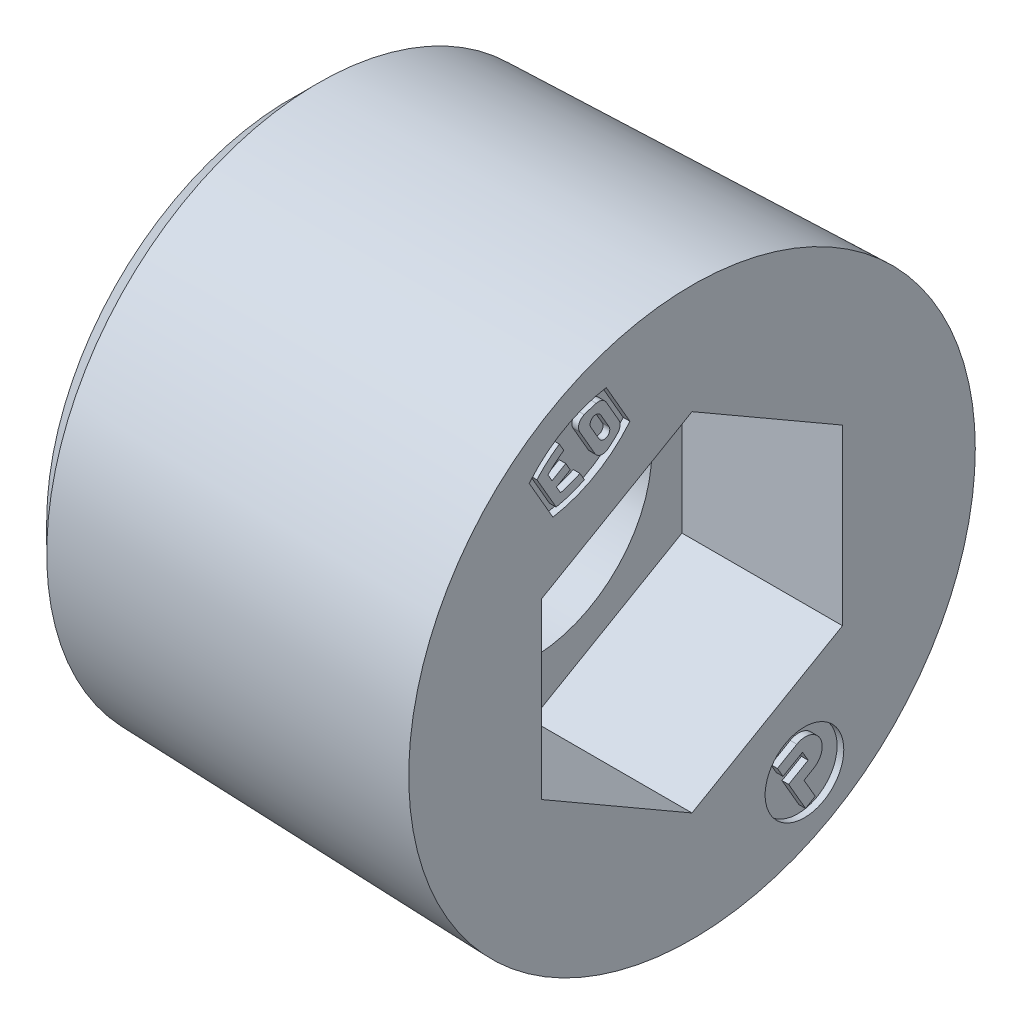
ISO-10303-21;
HEADER;
FILE_DESCRIPTION(('STEP AP214'),'2;1');
FILE_NAME('part.step','',(''),(''),'','','');
FILE_SCHEMA(('AUTOMOTIVE_DESIGN { 1 0 10303 214 1 1 1 1 }'));
ENDSEC;
DATA;
#1=APPLICATION_CONTEXT('core data for automotive mechanical design processes');
#2=APPLICATION_PROTOCOL_DEFINITION('international standard','automotive_design',2000,#1);
#3=PRODUCT_CONTEXT('',#1,'mechanical');
#4=PRODUCT('Part','Part','',(#3));
#5=PRODUCT_RELATED_PRODUCT_CATEGORY('part','',(#4));
#6=PRODUCT_DEFINITION_FORMATION('','',#4);
#7=PRODUCT_DEFINITION_CONTEXT('part definition',#1,'design');
#8=PRODUCT_DEFINITION('design','',#6,#7);
#9=PRODUCT_DEFINITION_SHAPE('','',#8);
#10=(LENGTH_UNIT() NAMED_UNIT(*) SI_UNIT(.MILLI.,.METRE.));
#11=(NAMED_UNIT(*) PLANE_ANGLE_UNIT() SI_UNIT($,.RADIAN.));
#12=(NAMED_UNIT(*) SI_UNIT($,.STERADIAN.) SOLID_ANGLE_UNIT());
#13=UNCERTAINTY_MEASURE_WITH_UNIT(LENGTH_MEASURE(1.E-05),#10,'distance_accuracy_value','');
#14=(GEOMETRIC_REPRESENTATION_CONTEXT(3) GLOBAL_UNCERTAINTY_ASSIGNED_CONTEXT((#13)) GLOBAL_UNIT_ASSIGNED_CONTEXT((#10,
#11,#12)) REPRESENTATION_CONTEXT('',''));
#15=CARTESIAN_POINT('',(0.,0.,0.));
#16=DIRECTION('',(0.,0.,1.));
#17=DIRECTION('',(1.,0.,0.));
#18=AXIS2_PLACEMENT_3D('',#15,#16,#17);
#19=CARTESIAN_POINT('',(0.,-5.42086972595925,-3.38839340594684));
#20=DIRECTION('',(1.,0.,0.));
#21=DIRECTION('',(0.,1.,0.));
#22=AXIS2_PLACEMENT_3D('',#19,#20,#21);
#23=PLANE('',#22);
#24=DIRECTION('',(0.,-0.499999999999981,0.86602540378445));
#25=VECTOR('',#24,1.);
#26=CARTESIAN_POINT('',(0.,-4.9843928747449,-3.13639348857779));
#27=LINE('',#26,#25);
#28=CARTESIAN_POINT('',(0.,-4.9843928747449,-3.13639348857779));
#29=VERTEX_POINT('',#28);
#30=CARTESIAN_POINT('',(0.,-5.32039287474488,-2.55442441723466));
#31=VERTEX_POINT('',#30);
#32=EDGE_CURVE('E605',#29,#31,#27,.T.);
#33=ORIENTED_EDGE('',*,*,#32,.T.);
#34=DIRECTION('',(0.,-0.866025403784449,-0.499999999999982));
#35=VECTOR('',#34,1.);
#36=CARTESIAN_POINT('',(0.,-5.32039287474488,-2.55442441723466));
#37=LINE('',#36,#35);
#38=CARTESIAN_POINT('',(0.,-5.61137741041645,-2.72242441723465));
#39=VERTEX_POINT('',#38);
#40=EDGE_CURVE('E539',#31,#39,#37,.T.);
#41=ORIENTED_EDGE('',*,*,#40,.T.);
#42=DIRECTION('',(0.,0.499999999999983,-0.866025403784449));
#43=VECTOR('',#42,1.);
#44=CARTESIAN_POINT('',(0.,-5.61137741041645,-2.72242441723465));
#45=LINE('',#44,#43);
#46=CARTESIAN_POINT('',(0.,-5.27537741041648,-3.30439348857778));
#47=VERTEX_POINT('',#46);
#48=EDGE_CURVE('E541',#39,#47,#45,.T.);
#49=ORIENTED_EDGE('',*,*,#48,.T.);
#50=DIRECTION('',(0.,-0.866025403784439,-0.5));
#51=VECTOR('',#50,1.);
#52=CARTESIAN_POINT('',(0.,-5.27537741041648,-3.30439348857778));
#53=LINE('',#52,#51);
#54=CARTESIAN_POINT('',(0.,-5.56636194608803,-3.47239348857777));
#55=VERTEX_POINT('',#54);
#56=EDGE_CURVE('E803',#47,#55,#53,.T.);
#57=ORIENTED_EDGE('',*,*,#56,.T.);
#58=DIRECTION('',(0.,-0.5,0.866025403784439));
#59=VECTOR('',#58,1.);
#60=CARTESIAN_POINT('',(0.,-5.56636194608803,-3.47239348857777));
#61=LINE('',#60,#59);
#62=CARTESIAN_POINT('',(0.,-5.90236194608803,-2.89042441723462));
#63=VERTEX_POINT('',#62);
#64=EDGE_CURVE('E630',#55,#63,#61,.T.);
#65=ORIENTED_EDGE('',*,*,#64,.T.);
#66=DIRECTION('',(0.,-0.866025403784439,-0.5));
#67=VECTOR('',#66,1.);
#68=CARTESIAN_POINT('',(0.,-5.90236194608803,-2.89042441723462));
#69=LINE('',#68,#67);
#70=CARTESIAN_POINT('',(0.,-6.77531555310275,-3.39442441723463));
#71=VERTEX_POINT('',#70);
#72=EDGE_CURVE('E551',#63,#71,#69,.T.);
#73=ORIENTED_EDGE('',*,*,#72,.T.);
#74=DIRECTION('',(0.,0.499999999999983,-0.866025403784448));
#75=VECTOR('',#74,1.);
#76=CARTESIAN_POINT('',(0.,-6.77531555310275,-3.39442441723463));
#77=LINE('',#76,#75);
#78=CARTESIAN_POINT('',(0.,-6.60731555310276,-3.6854089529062));
#79=VERTEX_POINT('',#78);
#80=EDGE_CURVE('E550',#71,#79,#77,.T.);
#81=ORIENTED_EDGE('',*,*,#80,.T.);
#82=DIRECTION('',(0.,0.866025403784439,0.5));
#83=VECTOR('',#82,1.);
#84=CARTESIAN_POINT('',(0.,-6.60731555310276,-3.6854089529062));
#85=LINE('',#84,#83);
#86=CARTESIAN_POINT('',(0.,-6.02534648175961,-3.3494089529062));
#87=VERTEX_POINT('',#86);
#88=EDGE_CURVE('E599',#79,#87,#85,.T.);
#89=ORIENTED_EDGE('',*,*,#88,.T.);
#90=DIRECTION('',(0.,0.5,-0.866025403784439));
#91=VECTOR('',#90,1.);
#92=CARTESIAN_POINT('',(0.,-6.02534648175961,-3.3494089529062));
#93=LINE('',#92,#91);
#94=CARTESIAN_POINT('',(0.,-5.85734648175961,-3.64039348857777));
#95=VERTEX_POINT('',#94);
#96=EDGE_CURVE('E598',#87,#95,#93,.T.);
#97=ORIENTED_EDGE('',*,*,#96,.T.);
#98=CARTESIAN_POINT('',(0.,-5.42086972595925,-3.38839340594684));
#99=DIRECTION('',(1.,0.,0.));
#100=DIRECTION('',(0.,0.,-1.));
#101=AXIS2_PLACEMENT_3D('',#98,#99,#100);
#102=CIRCLE('',#101,0.504);
#103=EDGE_CURVE('E11',#95,#29,#102,.T.);
#104=ORIENTED_EDGE('',*,*,#103,.T.);
#105=EDGE_LOOP('',(#33,#41,#49,#57,#65,#73,#81,#89,#97,#104));
#106=FACE_BOUND('',#105,.T.);
#107=ADVANCED_FACE('F16',(#106),#23,.T.);
#108=CARTESIAN_POINT('',(-0.2,-5.42086972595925,-3.38839340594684));
#109=DIRECTION('',(-1.,0.,0.));
#110=DIRECTION('',(0.,0.,-1.));
#111=AXIS2_PLACEMENT_3D('',#108,#109,#110);
#112=CYLINDRICAL_SURFACE('',#111,0.504);
#113=ORIENTED_EDGE('',*,*,#103,.F.);
#114=DIRECTION('',(1.,0.,0.));
#115=VECTOR('',#114,1.);
#116=CARTESIAN_POINT('',(-0.2,-5.85734648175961,-3.64039348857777));
#117=LINE('',#116,#115);
#118=CARTESIAN_POINT('',(-0.2,-5.85734648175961,-3.64039348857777));
#119=VERTEX_POINT('',#118);
#120=EDGE_CURVE('E27',#119,#95,#117,.T.);
#121=ORIENTED_EDGE('',*,*,#120,.F.);
#122=CARTESIAN_POINT('',(-0.2,-5.42086972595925,-3.38839340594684));
#123=DIRECTION('',(1.,0.,0.));
#124=DIRECTION('',(0.,0.,-1.));
#125=AXIS2_PLACEMENT_3D('',#122,#123,#124);
#126=CIRCLE('',#125,0.504);
#127=CARTESIAN_POINT('',(-0.2,-4.9843928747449,-3.13639348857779));
#128=VERTEX_POINT('',#127);
#129=EDGE_CURVE('E641',#119,#128,#126,.T.);
#130=ORIENTED_EDGE('',*,*,#129,.T.);
#131=DIRECTION('',(1.,0.,0.));
#132=VECTOR('',#131,1.);
#133=CARTESIAN_POINT('',(-0.2,-4.9843928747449,-3.13639348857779));
#134=LINE('',#133,#132);
#135=EDGE_CURVE('E540',#128,#29,#134,.T.);
#136=ORIENTED_EDGE('',*,*,#135,.T.);
#137=EDGE_LOOP('',(#113,#121,#130,#136));
#138=FACE_BOUND('',#137,.T.);
#139=ADVANCED_FACE('F964',(#138),#112,.T.);
#140=CARTESIAN_POINT('',(-0.2,-6.02534648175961,-3.3494089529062));
#141=DIRECTION('',(0.,-0.866025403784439,-0.5));
#142=DIRECTION('',(0.,0.5,-0.866025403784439));
#143=AXIS2_PLACEMENT_3D('',#140,#141,#142);
#144=PLANE('',#143);
#145=ORIENTED_EDGE('',*,*,#96,.F.);
#146=DIRECTION('',(1.,0.,0.));
#147=VECTOR('',#146,1.);
#148=CARTESIAN_POINT('',(-0.2,-6.02534648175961,-3.3494089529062));
#149=LINE('',#148,#147);
#150=CARTESIAN_POINT('',(-0.2,-6.02534648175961,-3.3494089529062));
#151=VERTEX_POINT('',#150);
#152=EDGE_CURVE('E595',#151,#87,#149,.T.);
#153=ORIENTED_EDGE('',*,*,#152,.F.);
#154=DIRECTION('',(0.,0.5,-0.866025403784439));
#155=VECTOR('',#154,1.);
#156=CARTESIAN_POINT('',(-0.2,-6.02534648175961,-3.3494089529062));
#157=LINE('',#156,#155);
#158=EDGE_CURVE('E672',#151,#119,#157,.T.);
#159=ORIENTED_EDGE('',*,*,#158,.T.);
#160=ORIENTED_EDGE('',*,*,#120,.T.);
#161=EDGE_LOOP('',(#145,#153,#159,#160));
#162=FACE_BOUND('',#161,.T.);
#163=ADVANCED_FACE('F970',(#162),#144,.T.);
#164=CARTESIAN_POINT('',(-0.2,-6.60731555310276,-3.6854089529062));
#165=DIRECTION('',(0.,0.5,-0.866025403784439));
#166=DIRECTION('',(-1.,0.,0.));
#167=AXIS2_PLACEMENT_3D('',#164,#165,#166);
#168=PLANE('',#167);
#169=ORIENTED_EDGE('',*,*,#88,.F.);
#170=DIRECTION('',(1.,0.,0.));
#171=VECTOR('',#170,1.);
#172=CARTESIAN_POINT('',(-0.2,-6.60731555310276,-3.6854089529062));
#173=LINE('',#172,#171);
#174=CARTESIAN_POINT('',(-0.2,-6.60731555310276,-3.6854089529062));
#175=VERTEX_POINT('',#174);
#176=EDGE_CURVE('E573',#175,#79,#173,.T.);
#177=ORIENTED_EDGE('',*,*,#176,.F.);
#178=DIRECTION('',(0.,0.866025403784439,0.5));
#179=VECTOR('',#178,1.);
#180=CARTESIAN_POINT('',(-0.2,-6.60731555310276,-3.6854089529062));
#181=LINE('',#180,#179);
#182=EDGE_CURVE('E676',#175,#151,#181,.T.);
#183=ORIENTED_EDGE('',*,*,#182,.T.);
#184=ORIENTED_EDGE('',*,*,#152,.T.);
#185=EDGE_LOOP('',(#169,#177,#183,#184));
#186=FACE_BOUND('',#185,.T.);
#187=ADVANCED_FACE('F988',(#186),#168,.T.);
#188=CARTESIAN_POINT('',(-0.2,-6.77531555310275,-3.39442441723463));
#189=DIRECTION('',(0.,-0.866025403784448,-0.499999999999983));
#190=DIRECTION('',(0.,0.499999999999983,-0.866025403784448));
#191=AXIS2_PLACEMENT_3D('',#188,#189,#190);
#192=PLANE('',#191);
#193=ORIENTED_EDGE('',*,*,#80,.F.);
#194=DIRECTION('',(1.,0.,0.));
#195=VECTOR('',#194,1.);
#196=CARTESIAN_POINT('',(-0.2,-6.77531555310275,-3.39442441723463));
#197=LINE('',#196,#195);
#198=CARTESIAN_POINT('',(-0.2,-6.77531555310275,-3.39442441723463));
#199=VERTEX_POINT('',#198);
#200=EDGE_CURVE('E546',#199,#71,#197,.T.);
#201=ORIENTED_EDGE('',*,*,#200,.F.);
#202=DIRECTION('',(0.,0.499999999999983,-0.866025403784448));
#203=VECTOR('',#202,1.);
#204=CARTESIAN_POINT('',(-0.2,-6.77531555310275,-3.39442441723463));
#205=LINE('',#204,#203);
#206=EDGE_CURVE('E484',#199,#175,#205,.T.);
#207=ORIENTED_EDGE('',*,*,#206,.T.);
#208=ORIENTED_EDGE('',*,*,#176,.T.);
#209=EDGE_LOOP('',(#193,#201,#207,#208));
#210=FACE_BOUND('',#209,.T.);
#211=ADVANCED_FACE('F984',(#210),#192,.T.);
#212=CARTESIAN_POINT('',(-0.2,-5.90236194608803,-2.89042441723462));
#213=DIRECTION('',(0.,-0.5,0.866025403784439));
#214=DIRECTION('',(-1.,0.,0.));
#215=AXIS2_PLACEMENT_3D('',#212,#213,#214);
#216=PLANE('',#215);
#217=ORIENTED_EDGE('',*,*,#72,.F.);
#218=DIRECTION('',(1.,0.,0.));
#219=VECTOR('',#218,1.);
#220=CARTESIAN_POINT('',(-0.2,-5.90236194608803,-2.89042441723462));
#221=LINE('',#220,#219);
#222=CARTESIAN_POINT('',(-0.2,-5.90236194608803,-2.89042441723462));
#223=VERTEX_POINT('',#222);
#224=EDGE_CURVE('E634',#223,#63,#221,.T.);
#225=ORIENTED_EDGE('',*,*,#224,.F.);
#226=DIRECTION('',(0.,-0.866025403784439,-0.5));
#227=VECTOR('',#226,1.);
#228=CARTESIAN_POINT('',(-0.2,-5.90236194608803,-2.89042441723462));
#229=LINE('',#228,#227);
#230=EDGE_CURVE('E479',#223,#199,#229,.T.);
#231=ORIENTED_EDGE('',*,*,#230,.T.);
#232=ORIENTED_EDGE('',*,*,#200,.T.);
#233=EDGE_LOOP('',(#217,#225,#231,#232));
#234=FACE_BOUND('',#233,.T.);
#235=ADVANCED_FACE('F987',(#234),#216,.T.);
#236=CARTESIAN_POINT('',(-0.2,-5.56636194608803,-3.47239348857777));
#237=DIRECTION('',(0.,0.866025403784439,0.5));
#238=DIRECTION('',(1.,0.,0.));
#239=AXIS2_PLACEMENT_3D('',#236,#237,#238);
#240=PLANE('',#239);
#241=ORIENTED_EDGE('',*,*,#64,.F.);
#242=DIRECTION('',(1.,0.,0.));
#243=VECTOR('',#242,1.);
#244=CARTESIAN_POINT('',(-0.2,-5.56636194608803,-3.47239348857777));
#245=LINE('',#244,#243);
#246=CARTESIAN_POINT('',(-0.2,-5.56636194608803,-3.47239348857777));
#247=VERTEX_POINT('',#246);
#248=EDGE_CURVE('E355',#247,#55,#245,.T.);
#249=ORIENTED_EDGE('',*,*,#248,.F.);
#250=DIRECTION('',(0.,-0.5,0.866025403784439));
#251=VECTOR('',#250,1.);
#252=CARTESIAN_POINT('',(-0.2,-5.56636194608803,-3.47239348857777));
#253=LINE('',#252,#251);
#254=EDGE_CURVE('E483',#247,#223,#253,.T.);
#255=ORIENTED_EDGE('',*,*,#254,.T.);
#256=ORIENTED_EDGE('',*,*,#224,.T.);
#257=EDGE_LOOP('',(#241,#249,#255,#256));
#258=FACE_BOUND('',#257,.T.);
#259=ADVANCED_FACE('F1039',(#258),#240,.T.);
#260=CARTESIAN_POINT('',(-0.2,-5.27537741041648,-3.30439348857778));
#261=DIRECTION('',(0.,-0.5,0.866025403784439));
#262=DIRECTION('',(-1.,0.,0.));
#263=AXIS2_PLACEMENT_3D('',#260,#261,#262);
#264=PLANE('',#263);
#265=ORIENTED_EDGE('',*,*,#56,.F.);
#266=DIRECTION('',(1.,0.,0.));
#267=VECTOR('',#266,1.);
#268=CARTESIAN_POINT('',(-0.2,-5.27537741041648,-3.30439348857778));
#269=LINE('',#268,#267);
#270=CARTESIAN_POINT('',(-0.2,-5.27537741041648,-3.30439348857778));
#271=VERTEX_POINT('',#270);
#272=EDGE_CURVE('E344',#271,#47,#269,.T.);
#273=ORIENTED_EDGE('',*,*,#272,.F.);
#274=DIRECTION('',(0.,-0.866025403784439,-0.5));
#275=VECTOR('',#274,1.);
#276=CARTESIAN_POINT('',(-0.2,-5.27537741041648,-3.30439348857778));
#277=LINE('',#276,#275);
#278=EDGE_CURVE('E446',#271,#247,#277,.T.);
#279=ORIENTED_EDGE('',*,*,#278,.T.);
#280=ORIENTED_EDGE('',*,*,#248,.T.);
#281=EDGE_LOOP('',(#265,#273,#279,#280));
#282=FACE_BOUND('',#281,.T.);
#283=ADVANCED_FACE('F1066',(#282),#264,.T.);
#284=CARTESIAN_POINT('',(-0.2,-5.61137741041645,-2.72242441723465));
#285=DIRECTION('',(0.,-0.866025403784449,-0.499999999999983));
#286=DIRECTION('',(0.,0.499999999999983,-0.866025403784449));
#287=AXIS2_PLACEMENT_3D('',#284,#285,#286);
#288=PLANE('',#287);
#289=ORIENTED_EDGE('',*,*,#48,.F.);
#290=DIRECTION('',(1.,0.,0.));
#291=VECTOR('',#290,1.);
#292=CARTESIAN_POINT('',(-0.2,-5.61137741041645,-2.72242441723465));
#293=LINE('',#292,#291);
#294=CARTESIAN_POINT('',(-0.2,-5.61137741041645,-2.72242441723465));
#295=VERTEX_POINT('',#294);
#296=EDGE_CURVE('E545',#295,#39,#293,.T.);
#297=ORIENTED_EDGE('',*,*,#296,.F.);
#298=DIRECTION('',(0.,0.499999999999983,-0.866025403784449));
#299=VECTOR('',#298,1.);
#300=CARTESIAN_POINT('',(-0.2,-5.61137741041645,-2.72242441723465));
#301=LINE('',#300,#299);
#302=EDGE_CURVE('E567',#295,#271,#301,.T.);
#303=ORIENTED_EDGE('',*,*,#302,.T.);
#304=ORIENTED_EDGE('',*,*,#272,.T.);
#305=EDGE_LOOP('',(#289,#297,#303,#304));
#306=FACE_BOUND('',#305,.T.);
#307=ADVANCED_FACE('F1008',(#306),#288,.T.);
#308=CARTESIAN_POINT('',(-0.2,-5.32039287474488,-2.55442441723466));
#309=DIRECTION('',(0.,-0.499999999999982,0.866025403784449));
#310=DIRECTION('',(-1.,0.,0.));
#311=AXIS2_PLACEMENT_3D('',#308,#309,#310);
#312=PLANE('',#311);
#313=ORIENTED_EDGE('',*,*,#40,.F.);
#314=DIRECTION('',(1.,0.,0.));
#315=VECTOR('',#314,1.);
#316=CARTESIAN_POINT('',(-0.2,-5.32039287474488,-2.55442441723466));
#317=LINE('',#316,#315);
#318=CARTESIAN_POINT('',(-0.2,-5.32039287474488,-2.55442441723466));
#319=VERTEX_POINT('',#318);
#320=EDGE_CURVE('E535',#319,#31,#317,.T.);
#321=ORIENTED_EDGE('',*,*,#320,.F.);
#322=DIRECTION('',(0.,-0.866025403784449,-0.499999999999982));
#323=VECTOR('',#322,1.);
#324=CARTESIAN_POINT('',(-0.2,-5.32039287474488,-2.55442441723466));
#325=LINE('',#324,#323);
#326=EDGE_CURVE('E570',#319,#295,#325,.T.);
#327=ORIENTED_EDGE('',*,*,#326,.T.);
#328=ORIENTED_EDGE('',*,*,#296,.T.);
#329=EDGE_LOOP('',(#313,#321,#327,#328));
#330=FACE_BOUND('',#329,.T.);
#331=ADVANCED_FACE('F1004',(#330),#312,.T.);
#332=CARTESIAN_POINT('',(-0.2,-4.9843928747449,-3.13639348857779));
#333=DIRECTION('',(0.,0.86602540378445,0.499999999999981));
#334=DIRECTION('',(1.,0.,0.));
#335=AXIS2_PLACEMENT_3D('',#332,#333,#334);
#336=PLANE('',#335);
#337=ORIENTED_EDGE('',*,*,#32,.F.);
#338=ORIENTED_EDGE('',*,*,#135,.F.);
#339=DIRECTION('',(0.,-0.499999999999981,0.86602540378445));
#340=VECTOR('',#339,1.);
#341=CARTESIAN_POINT('',(-0.2,-4.9843928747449,-3.13639348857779));
#342=LINE('',#341,#340);
#343=EDGE_CURVE('E506',#128,#319,#342,.T.);
#344=ORIENTED_EDGE('',*,*,#343,.T.);
#345=ORIENTED_EDGE('',*,*,#320,.T.);
#346=EDGE_LOOP('',(#337,#338,#344,#345));
#347=FACE_BOUND('',#346,.T.);
#348=ADVANCED_FACE('F1007',(#347),#336,.T.);
#349=CARTESIAN_POINT('',(-0.2,-5.82385421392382,-3.36240379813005));
#350=DIRECTION('',(1.,0.,0.));
#351=DIRECTION('',(0.,1.,0.));
#352=AXIS2_PLACEMENT_3D('',#349,#350,#351);
#353=PLANE('',#352);
#354=ORIENTED_EDGE('',*,*,#343,.F.);
#355=ORIENTED_EDGE('',*,*,#129,.F.);
#356=ORIENTED_EDGE('',*,*,#158,.F.);
#357=ORIENTED_EDGE('',*,*,#182,.F.);
#358=ORIENTED_EDGE('',*,*,#206,.F.);
#359=ORIENTED_EDGE('',*,*,#230,.F.);
#360=ORIENTED_EDGE('',*,*,#254,.F.);
#361=ORIENTED_EDGE('',*,*,#278,.F.);
#362=ORIENTED_EDGE('',*,*,#302,.F.);
#363=ORIENTED_EDGE('',*,*,#326,.F.);
#364=EDGE_LOOP('',(#354,#355,#356,#357,#358,#359,#360,#361,#362,#363));
#365=FACE_BOUND('',#364,.T.);
#366=CARTESIAN_POINT('',(-0.2,-5.82385421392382,-3.36240379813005));
#367=DIRECTION('',(1.,0.,0.));
#368=DIRECTION('',(0.,0.,-1.));
#369=AXIS2_PLACEMENT_3D('',#366,#367,#368);
#370=CIRCLE('',#369,1.176);
#371=CARTESIAN_POINT('',(-0.2,-5.82385421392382,-4.53840379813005));
#372=VERTEX_POINT('',#371);
#373=EDGE_CURVE('E503',#372,#372,#370,.T.);
#374=ORIENTED_EDGE('',*,*,#373,.T.);
#375=EDGE_LOOP('',(#374));
#376=FACE_BOUND('',#375,.T.);
#377=ADVANCED_FACE('F1020',(#365,#376),#353,.T.);
#378=CARTESIAN_POINT('',(-0.2,-5.82385421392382,-3.36240379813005));
#379=DIRECTION('',(-1.,0.,0.));
#380=DIRECTION('',(0.,0.,-1.));
#381=AXIS2_PLACEMENT_3D('',#378,#379,#380);
#382=CYLINDRICAL_SURFACE('',#381,1.176);
#383=ORIENTED_EDGE('',*,*,#373,.F.);
#384=EDGE_LOOP('',(#383));
#385=FACE_BOUND('',#384,.T.);
#386=CARTESIAN_POINT('',(0.,-5.82385421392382,-3.36240379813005));
#387=DIRECTION('',(1.,0.,0.));
#388=DIRECTION('',(0.,0.,-1.));
#389=AXIS2_PLACEMENT_3D('',#386,#387,#388);
#390=CIRCLE('',#389,1.176);
#391=CARTESIAN_POINT('',(0.,-5.82385421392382,-4.53840379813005));
#392=VERTEX_POINT('',#391);
#393=EDGE_CURVE('E490',#392,#392,#390,.T.);
#394=ORIENTED_EDGE('',*,*,#393,.T.);
#395=EDGE_LOOP('',(#394));
#396=FACE_BOUND('',#395,.T.);
#397=ADVANCED_FACE('F998',(#385,#396),#382,.F.);
#398=CARTESIAN_POINT('',(-0.2,3.35568181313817,1.93740379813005));
#399=DIRECTION('',(1.,0.,0.));
#400=DIRECTION('',(0.,1.,0.));
#401=AXIS2_PLACEMENT_3D('',#398,#399,#400);
#402=PLANE('',#401);
#403=CARTESIAN_POINT('',(-0.2,5.96144593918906,2.63008793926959));
#404=DIRECTION('',(1.,0.,0.));
#405=DIRECTION('',(0.,0.,-1.));
#406=AXIS2_PLACEMENT_3D('',#403,#404,#405);
#407=CIRCLE('',#406,0.171);
#408=CARTESIAN_POINT('',(-0.2,5.87594593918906,2.77817828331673));
#409=VERTEX_POINT('',#408);
#410=CARTESIAN_POINT('',(-0.2,6.04694593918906,2.48199759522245));
#411=VERTEX_POINT('',#410);
#412=EDGE_CURVE('E770',#409,#411,#407,.T.);
#413=ORIENTED_EDGE('',*,*,#412,.T.);
#414=DIRECTION('',(0.,0.866025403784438,0.5));
#415=VECTOR('',#414,1.);
#416=CARTESIAN_POINT('',(-0.2,6.04694593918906,2.48199759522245));
#417=LINE('',#416,#415);
#418=CARTESIAN_POINT('',(-0.2,6.47476248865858,2.72899759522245));
#419=VERTEX_POINT('',#418);
#420=EDGE_CURVE('E523',#411,#419,#417,.T.);
#421=ORIENTED_EDGE('',*,*,#420,.T.);
#422=CARTESIAN_POINT('',(-0.2,6.38926248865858,2.87708793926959));
#423=DIRECTION('',(1.,0.,0.));
#424=DIRECTION('',(0.,0.,-1.));
#425=AXIS2_PLACEMENT_3D('',#422,#423,#424);
#426=CIRCLE('',#425,0.171);
#427=CARTESIAN_POINT('',(-0.2,6.30376248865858,3.02517828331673));
#428=VERTEX_POINT('',#427);
#429=EDGE_CURVE('E747',#419,#428,#426,.T.);
#430=ORIENTED_EDGE('',*,*,#429,.T.);
#431=DIRECTION('',(0.,-0.866025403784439,-0.5));
#432=VECTOR('',#431,1.);
#433=CARTESIAN_POINT('',(-0.2,6.30376248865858,3.02517828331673));
#434=LINE('',#433,#432);
#435=EDGE_CURVE('E555',#428,#409,#434,.T.);
#436=ORIENTED_EDGE('',*,*,#435,.T.);
#437=EDGE_LOOP('',(#413,#421,#430,#436));
#438=FACE_BOUND('',#437,.T.);
#439=ADVANCED_FACE('F994',(#438),#402,.T.);
#440=CARTESIAN_POINT('',(0.,3.3556818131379,1.93740379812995));
#441=DIRECTION('',(1.,0.,0.));
#442=DIRECTION('',(0.,1.,0.));
#443=AXIS2_PLACEMENT_3D('',#440,#441,#442);
#444=PLANE('',#443);
#445=DIRECTION('',(0.,0.866025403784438,0.5));
#446=VECTOR('',#445,1.);
#447=CARTESIAN_POINT('',(0.,6.04694593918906,2.48199759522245));
#448=LINE('',#447,#446);
#449=CARTESIAN_POINT('',(0.,6.04694593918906,2.48199759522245));
#450=VERTEX_POINT('',#449);
#451=CARTESIAN_POINT('',(0.,6.47476248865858,2.72899759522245));
#452=VERTEX_POINT('',#451);
#453=EDGE_CURVE('E661',#450,#452,#448,.T.);
#454=ORIENTED_EDGE('',*,*,#453,.F.);
#455=CARTESIAN_POINT('',(0.,5.96144593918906,2.63008793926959));
#456=DIRECTION('',(1.,0.,0.));
#457=DIRECTION('',(0.,0.,-1.));
#458=AXIS2_PLACEMENT_3D('',#455,#456,#457);
#459=CIRCLE('',#458,0.171);
#460=CARTESIAN_POINT('',(0.,5.87594593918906,2.77817828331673));
#461=VERTEX_POINT('',#460);
#462=EDGE_CURVE('E629',#461,#450,#459,.T.);
#463=ORIENTED_EDGE('',*,*,#462,.F.);
#464=DIRECTION('',(0.,-0.866025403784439,-0.5));
#465=VECTOR('',#464,1.);
#466=CARTESIAN_POINT('',(0.,6.30376248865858,3.02517828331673));
#467=LINE('',#466,#465);
#468=CARTESIAN_POINT('',(0.,6.30376248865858,3.02517828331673));
#469=VERTEX_POINT('',#468);
#470=EDGE_CURVE('E560',#469,#461,#467,.T.);
#471=ORIENTED_EDGE('',*,*,#470,.F.);
#472=CARTESIAN_POINT('',(0.,6.38926248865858,2.87708793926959));
#473=DIRECTION('',(1.,0.,0.));
#474=DIRECTION('',(0.,0.,-1.));
#475=AXIS2_PLACEMENT_3D('',#472,#473,#474);
#476=CIRCLE('',#475,0.171);
#477=EDGE_CURVE('E684',#452,#469,#476,.T.);
#478=ORIENTED_EDGE('',*,*,#477,.F.);
#479=EDGE_LOOP('',(#454,#463,#471,#478));
#480=FACE_BOUND('',#479,.T.);
#481=CARTESIAN_POINT('',(0.,3.3556818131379,1.93740379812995));
#482=DIRECTION('',(1.,0.,0.));
#483=DIRECTION('',(0.,0.,-1.));
#484=AXIS2_PLACEMENT_3D('',#481,#482,#483);
#485=CIRCLE('',#484,3.61);
#486=CARTESIAN_POINT('',(0.,6.84512417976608,2.86254809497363));
#487=VERTEX_POINT('',#486);
#488=CARTESIAN_POINT('',(0.,6.72937518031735,3.22204112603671));
#489=VERTEX_POINT('',#488);
#490=EDGE_CURVE('E811',#487,#489,#485,.T.);
#491=ORIENTED_EDGE('',*,*,#490,.T.);
#492=CARTESIAN_POINT('',(0.,6.48078726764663,3.12738358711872));
#493=DIRECTION('',(1.,0.,0.));
#494=DIRECTION('',(0.,0.,-1.));
#495=AXIS2_PLACEMENT_3D('',#492,#493,#494);
#496=CIRCLE('',#495,0.266);
#497=CARTESIAN_POINT('',(0.,6.34778726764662,3.35774634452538));
#498=VERTEX_POINT('',#497);
#499=EDGE_CURVE('E518',#489,#498,#496,.T.);
#500=ORIENTED_EDGE('',*,*,#499,.T.);
#501=DIRECTION('',(0.,-0.866025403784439,-0.5));
#502=VECTOR('',#501,1.);
#503=CARTESIAN_POINT('',(0.,6.34778726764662,3.35774634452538));
#504=LINE('',#503,#502);
#505=CARTESIAN_POINT('',(0.,5.56592116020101,2.90633573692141));
#506=VERTEX_POINT('',#505);
#507=EDGE_CURVE('E450',#498,#506,#504,.T.);
#508=ORIENTED_EDGE('',*,*,#507,.T.);
#509=CARTESIAN_POINT('',(0.,5.69892116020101,2.67597297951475));
#510=DIRECTION('',(1.,0.,0.));
#511=DIRECTION('',(0.,0.,-1.));
#512=AXIS2_PLACEMENT_3D('',#509,#510,#511);
#513=CIRCLE('',#512,0.266);
#514=CARTESIAN_POINT('',(0.,5.49265140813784,2.50801825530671));
#515=VERTEX_POINT('',#514);
#516=EDGE_CURVE('E378',#506,#515,#513,.T.);
#517=ORIENTED_EDGE('',*,*,#516,.T.);
#518=CARTESIAN_POINT('',(0.,8.29202661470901,4.78740379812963));
#519=DIRECTION('',(1.,0.,0.));
#520=DIRECTION('',(0.,0.,-1.));
#521=AXIS2_PLACEMENT_3D('',#518,#519,#520);
#522=CIRCLE('',#521,3.61);
#523=CARTESIAN_POINT('',(0.,5.7461069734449,2.22803020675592));
#524=VERTEX_POINT('',#523);
#525=EDGE_CURVE('E389',#515,#524,#522,.T.);
#526=ORIENTED_EDGE('',*,*,#525,.T.);
#527=CARTESIAN_POINT('',(0.,5.93370105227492,2.41661562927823));
#528=DIRECTION('',(1.,0.,0.));
#529=DIRECTION('',(0.,0.,-1.));
#530=AXIS2_PLACEMENT_3D('',#527,#528,#529);
#531=CIRCLE('',#530,0.266);
#532=CARTESIAN_POINT('',(0.,6.06670105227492,2.18625287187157));
#533=VERTEX_POINT('',#532);
#534=EDGE_CURVE('E508',#524,#533,#531,.T.);
#535=ORIENTED_EDGE('',*,*,#534,.T.);
#536=DIRECTION('',(0.,0.866025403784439,0.5));
#537=VECTOR('',#536,1.);
#538=CARTESIAN_POINT('',(0.,6.06670105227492,2.18625287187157));
#539=LINE('',#538,#537);
#540=CARTESIAN_POINT('',(0.,6.72100737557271,2.56401680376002));
#541=VERTEX_POINT('',#540);
#542=EDGE_CURVE('E827',#533,#541,#539,.T.);
#543=ORIENTED_EDGE('',*,*,#542,.T.);
#544=CARTESIAN_POINT('',(0.,6.58800737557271,2.79437956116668));
#545=DIRECTION('',(1.,0.,0.));
#546=DIRECTION('',(0.,0.,-1.));
#547=AXIS2_PLACEMENT_3D('',#544,#545,#546);
#548=CIRCLE('',#547,0.266);
#549=EDGE_CURVE('E507',#541,#487,#548,.T.);
#550=ORIENTED_EDGE('',*,*,#549,.T.);
#551=EDGE_LOOP('',(#491,#500,#508,#517,#526,#535,#543,#550));
#552=FACE_BOUND('',#551,.T.);
#553=ADVANCED_FACE('F997',(#480,#552),#444,.T.);
#554=CARTESIAN_POINT('',(-0.2,6.58800737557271,2.79437956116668));
#555=DIRECTION('',(-1.,0.,0.));
#556=DIRECTION('',(0.,0.,-1.));
#557=AXIS2_PLACEMENT_3D('',#554,#555,#556);
#558=CYLINDRICAL_SURFACE('',#557,0.266);
#559=ORIENTED_EDGE('',*,*,#549,.F.);
#560=DIRECTION('',(1.,0.,0.));
#561=VECTOR('',#560,1.);
#562=CARTESIAN_POINT('',(-0.2,6.72100737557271,2.56401680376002));
#563=LINE('',#562,#561);
#564=CARTESIAN_POINT('',(-0.2,6.72100737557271,2.56401680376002));
#565=VERTEX_POINT('',#564);
#566=EDGE_CURVE('E665',#565,#541,#563,.T.);
#567=ORIENTED_EDGE('',*,*,#566,.F.);
#568=CARTESIAN_POINT('',(-0.2,6.58800737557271,2.79437956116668));
#569=DIRECTION('',(1.,0.,0.));
#570=DIRECTION('',(0.,0.,-1.));
#571=AXIS2_PLACEMENT_3D('',#568,#569,#570);
#572=CIRCLE('',#571,0.266);
#573=CARTESIAN_POINT('',(-0.2,6.84512417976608,2.86254809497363));
#574=VERTEX_POINT('',#573);
#575=EDGE_CURVE('E533',#565,#574,#572,.T.);
#576=ORIENTED_EDGE('',*,*,#575,.T.);
#577=DIRECTION('',(1.,0.,0.));
#578=VECTOR('',#577,1.);
#579=CARTESIAN_POINT('',(-0.2,6.84512417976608,2.86254809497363));
#580=LINE('',#579,#578);
#581=EDGE_CURVE('E807',#574,#487,#580,.T.);
#582=ORIENTED_EDGE('',*,*,#581,.T.);
#583=EDGE_LOOP('',(#559,#567,#576,#582));
#584=FACE_BOUND('',#583,.T.);
#585=ADVANCED_FACE('F1018',(#584),#558,.T.);
#586=CARTESIAN_POINT('',(-0.2,6.38926248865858,2.87708793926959));
#587=DIRECTION('',(-1.,0.,0.));
#588=DIRECTION('',(0.,0.,-1.));
#589=AXIS2_PLACEMENT_3D('',#586,#587,#588);
#590=CYLINDRICAL_SURFACE('',#589,0.171);
#591=ORIENTED_EDGE('',*,*,#477,.T.);
#592=DIRECTION('',(1.,0.,0.));
#593=VECTOR('',#592,1.);
#594=CARTESIAN_POINT('',(-0.2,6.30376248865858,3.02517828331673));
#595=LINE('',#594,#593);
#596=EDGE_CURVE('E559',#428,#469,#595,.T.);
#597=ORIENTED_EDGE('',*,*,#596,.F.);
#598=ORIENTED_EDGE('',*,*,#429,.F.);
#599=DIRECTION('',(1.,0.,0.));
#600=VECTOR('',#599,1.);
#601=CARTESIAN_POINT('',(-0.2,6.47476248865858,2.72899759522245));
#602=LINE('',#601,#600);
#603=EDGE_CURVE('E528',#419,#452,#602,.T.);
#604=ORIENTED_EDGE('',*,*,#603,.T.);
#605=EDGE_LOOP('',(#591,#597,#598,#604));
#606=FACE_BOUND('',#605,.T.);
#607=ADVANCED_FACE('F1077',(#606),#590,.F.);
#608=CARTESIAN_POINT('',(-0.2,6.30376248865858,3.02517828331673));
#609=DIRECTION('',(0.,-0.5,0.866025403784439));
#610=DIRECTION('',(-1.,0.,0.));
#611=AXIS2_PLACEMENT_3D('',#608,#609,#610);
#612=PLANE('',#611);
#613=ORIENTED_EDGE('',*,*,#470,.T.);
#614=DIRECTION('',(1.,0.,0.));
#615=VECTOR('',#614,1.);
#616=CARTESIAN_POINT('',(-0.2,5.87594593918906,2.77817828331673));
#617=LINE('',#616,#615);
#618=EDGE_CURVE('E566',#409,#461,#617,.T.);
#619=ORIENTED_EDGE('',*,*,#618,.F.);
#620=ORIENTED_EDGE('',*,*,#435,.F.);
#621=ORIENTED_EDGE('',*,*,#596,.T.);
#622=EDGE_LOOP('',(#613,#619,#620,#621));
#623=FACE_BOUND('',#622,.T.);
#624=ADVANCED_FACE('F1080',(#623),#612,.F.);
#625=CARTESIAN_POINT('',(-0.2,5.96144593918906,2.63008793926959));
#626=DIRECTION('',(-1.,0.,0.));
#627=DIRECTION('',(0.,0.,-1.));
#628=AXIS2_PLACEMENT_3D('',#625,#626,#627);
#629=CYLINDRICAL_SURFACE('',#628,0.171);
#630=ORIENTED_EDGE('',*,*,#462,.T.);
#631=DIRECTION('',(1.,0.,0.));
#632=VECTOR('',#631,1.);
#633=CARTESIAN_POINT('',(-0.2,6.04694593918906,2.48199759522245));
#634=LINE('',#633,#632);
#635=EDGE_CURVE('E527',#411,#450,#634,.T.);
#636=ORIENTED_EDGE('',*,*,#635,.F.);
#637=ORIENTED_EDGE('',*,*,#412,.F.);
#638=ORIENTED_EDGE('',*,*,#618,.T.);
#639=EDGE_LOOP('',(#630,#636,#637,#638));
#640=FACE_BOUND('',#639,.T.);
#641=ADVANCED_FACE('F1105',(#640),#629,.F.);
#642=CARTESIAN_POINT('',(-0.2,6.04694593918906,2.48199759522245));
#643=DIRECTION('',(0.,0.5,-0.866025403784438));
#644=DIRECTION('',(-1.,0.,0.));
#645=AXIS2_PLACEMENT_3D('',#642,#643,#644);
#646=PLANE('',#645);
#647=ORIENTED_EDGE('',*,*,#453,.T.);
#648=ORIENTED_EDGE('',*,*,#603,.F.);
#649=ORIENTED_EDGE('',*,*,#420,.F.);
#650=ORIENTED_EDGE('',*,*,#635,.T.);
#651=EDGE_LOOP('',(#647,#648,#649,#650));
#652=FACE_BOUND('',#651,.T.);
#653=ADVANCED_FACE('F1054',(#652),#646,.F.);
#654=CARTESIAN_POINT('',(-0.2,6.06670105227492,2.18625287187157));
#655=DIRECTION('',(0.,0.5,-0.866025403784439));
#656=DIRECTION('',(-1.,0.,0.));
#657=AXIS2_PLACEMENT_3D('',#654,#655,#656);
#658=PLANE('',#657);
#659=ORIENTED_EDGE('',*,*,#542,.F.);
#660=DIRECTION('',(1.,0.,0.));
#661=VECTOR('',#660,1.);
#662=CARTESIAN_POINT('',(-0.2,6.06670105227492,2.18625287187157));
#663=LINE('',#662,#661);
#664=CARTESIAN_POINT('',(-0.2,6.06670105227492,2.18625287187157));
#665=VERTEX_POINT('',#664);
#666=EDGE_CURVE('E512',#665,#533,#663,.T.);
#667=ORIENTED_EDGE('',*,*,#666,.F.);
#668=DIRECTION('',(0.,0.866025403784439,0.5));
#669=VECTOR('',#668,1.);
#670=CARTESIAN_POINT('',(-0.2,6.06670105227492,2.18625287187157));
#671=LINE('',#670,#669);
#672=EDGE_CURVE('E696',#665,#565,#671,.T.);
#673=ORIENTED_EDGE('',*,*,#672,.T.);
#674=ORIENTED_EDGE('',*,*,#566,.T.);
#675=EDGE_LOOP('',(#659,#667,#673,#674));
#676=FACE_BOUND('',#675,.T.);
#677=ADVANCED_FACE('F1050',(#676),#658,.T.);
#678=CARTESIAN_POINT('',(-0.2,5.93370105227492,2.41661562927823));
#679=DIRECTION('',(-1.,0.,0.));
#680=DIRECTION('',(0.,0.,-1.));
#681=AXIS2_PLACEMENT_3D('',#678,#679,#680);
#682=CYLINDRICAL_SURFACE('',#681,0.266);
#683=ORIENTED_EDGE('',*,*,#534,.F.);
#684=DIRECTION('',(1.,0.,0.));
#685=VECTOR('',#684,1.);
#686=CARTESIAN_POINT('',(-0.2,5.7461069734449,2.22803020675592));
#687=LINE('',#686,#685);
#688=CARTESIAN_POINT('',(-0.2,5.7461069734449,2.22803020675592));
#689=VERTEX_POINT('',#688);
#690=EDGE_CURVE('E513',#689,#524,#687,.T.);
#691=ORIENTED_EDGE('',*,*,#690,.F.);
#692=CARTESIAN_POINT('',(-0.2,5.93370105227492,2.41661562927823));
#693=DIRECTION('',(1.,0.,0.));
#694=DIRECTION('',(0.,0.,-1.));
#695=AXIS2_PLACEMENT_3D('',#692,#693,#694);
#696=CIRCLE('',#695,0.266);
#697=EDGE_CURVE('E700',#689,#665,#696,.T.);
#698=ORIENTED_EDGE('',*,*,#697,.T.);
#699=ORIENTED_EDGE('',*,*,#666,.T.);
#700=EDGE_LOOP('',(#683,#691,#698,#699));
#701=FACE_BOUND('',#700,.T.);
#702=ADVANCED_FACE('F1053',(#701),#682,.T.);
#703=CARTESIAN_POINT('',(-0.2,8.29202661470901,4.78740379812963));
#704=DIRECTION('',(-1.,0.,0.));
#705=DIRECTION('',(0.,0.,-1.));
#706=AXIS2_PLACEMENT_3D('',#703,#704,#705);
#707=CYLINDRICAL_SURFACE('',#706,3.61);
#708=ORIENTED_EDGE('',*,*,#525,.F.);
#709=DIRECTION('',(1.,0.,0.));
#710=VECTOR('',#709,1.);
#711=CARTESIAN_POINT('',(-0.2,5.49265140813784,2.50801825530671));
#712=LINE('',#711,#710);
#713=CARTESIAN_POINT('',(-0.2,5.49265140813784,2.50801825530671));
#714=VERTEX_POINT('',#713);
#715=EDGE_CURVE('E844',#714,#515,#712,.T.);
#716=ORIENTED_EDGE('',*,*,#715,.F.);
#717=CARTESIAN_POINT('',(-0.2,8.29202661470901,4.78740379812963));
#718=DIRECTION('',(1.,0.,0.));
#719=DIRECTION('',(0.,0.,-1.));
#720=AXIS2_PLACEMENT_3D('',#717,#718,#719);
#721=CIRCLE('',#720,3.61);
#722=EDGE_CURVE('E588',#714,#689,#721,.T.);
#723=ORIENTED_EDGE('',*,*,#722,.T.);
#724=ORIENTED_EDGE('',*,*,#690,.T.);
#725=EDGE_LOOP('',(#708,#716,#723,#724));
#726=FACE_BOUND('',#725,.T.);
#727=ADVANCED_FACE('F1099',(#726),#707,.T.);
#728=CARTESIAN_POINT('',(-0.2,5.69892116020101,2.67597297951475));
#729=DIRECTION('',(-1.,0.,0.));
#730=DIRECTION('',(0.,0.,-1.));
#731=AXIS2_PLACEMENT_3D('',#728,#729,#730);
#732=CYLINDRICAL_SURFACE('',#731,0.266);
#733=ORIENTED_EDGE('',*,*,#516,.F.);
#734=DIRECTION('',(1.,0.,0.));
#735=VECTOR('',#734,1.);
#736=CARTESIAN_POINT('',(-0.2,5.56592116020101,2.90633573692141));
#737=LINE('',#736,#735);
#738=CARTESIAN_POINT('',(-0.2,5.56592116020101,2.90633573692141));
#739=VERTEX_POINT('',#738);
#740=EDGE_CURVE('E448',#739,#506,#737,.T.);
#741=ORIENTED_EDGE('',*,*,#740,.F.);
#742=CARTESIAN_POINT('',(-0.2,5.69892116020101,2.67597297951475));
#743=DIRECTION('',(1.,0.,0.));
#744=DIRECTION('',(0.,0.,-1.));
#745=AXIS2_PLACEMENT_3D('',#742,#743,#744);
#746=CIRCLE('',#745,0.266);
#747=EDGE_CURVE('E583',#739,#714,#746,.T.);
#748=ORIENTED_EDGE('',*,*,#747,.T.);
#749=ORIENTED_EDGE('',*,*,#715,.T.);
#750=EDGE_LOOP('',(#733,#741,#748,#749));
#751=FACE_BOUND('',#750,.T.);
#752=ADVANCED_FACE('F1035',(#751),#732,.T.);
#753=CARTESIAN_POINT('',(-0.2,6.34778726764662,3.35774634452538));
#754=DIRECTION('',(0.,-0.5,0.866025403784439));
#755=DIRECTION('',(-1.,0.,0.));
#756=AXIS2_PLACEMENT_3D('',#753,#754,#755);
#757=PLANE('',#756);
#758=ORIENTED_EDGE('',*,*,#507,.F.);
#759=DIRECTION('',(1.,0.,0.));
#760=VECTOR('',#759,1.);
#761=CARTESIAN_POINT('',(-0.2,6.34778726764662,3.35774634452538));
#762=LINE('',#761,#760);
#763=CARTESIAN_POINT('',(-0.2,6.34778726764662,3.35774634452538));
#764=VERTEX_POINT('',#763);
#765=EDGE_CURVE('E514',#764,#498,#762,.T.);
#766=ORIENTED_EDGE('',*,*,#765,.F.);
#767=DIRECTION('',(0.,-0.866025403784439,-0.5));
#768=VECTOR('',#767,1.);
#769=CARTESIAN_POINT('',(-0.2,6.34778726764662,3.35774634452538));
#770=LINE('',#769,#768);
#771=EDGE_CURVE('E587',#764,#739,#770,.T.);
#772=ORIENTED_EDGE('',*,*,#771,.T.);
#773=ORIENTED_EDGE('',*,*,#740,.T.);
#774=EDGE_LOOP('',(#758,#766,#772,#773));
#775=FACE_BOUND('',#774,.T.);
#776=ADVANCED_FACE('F1031',(#775),#757,.T.);
#777=CARTESIAN_POINT('',(-0.2,6.48078726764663,3.12738358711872));
#778=DIRECTION('',(-1.,0.,0.));
#779=DIRECTION('',(0.,0.,-1.));
#780=AXIS2_PLACEMENT_3D('',#777,#778,#779);
#781=CYLINDRICAL_SURFACE('',#780,0.266);
#782=ORIENTED_EDGE('',*,*,#499,.F.);
#783=DIRECTION('',(1.,0.,0.));
#784=VECTOR('',#783,1.);
#785=CARTESIAN_POINT('',(-0.2,6.72937518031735,3.22204112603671));
#786=LINE('',#785,#784);
#787=CARTESIAN_POINT('',(-0.2,6.72937518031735,3.22204112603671));
#788=VERTEX_POINT('',#787);
#789=EDGE_CURVE('E810',#788,#489,#786,.T.);
#790=ORIENTED_EDGE('',*,*,#789,.F.);
#791=CARTESIAN_POINT('',(-0.2,6.48078726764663,3.12738358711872));
#792=DIRECTION('',(1.,0.,0.));
#793=DIRECTION('',(0.,0.,-1.));
#794=AXIS2_PLACEMENT_3D('',#791,#792,#793);
#795=CIRCLE('',#794,0.266);
#796=EDGE_CURVE('E740',#788,#764,#795,.T.);
#797=ORIENTED_EDGE('',*,*,#796,.T.);
#798=ORIENTED_EDGE('',*,*,#765,.T.);
#799=EDGE_LOOP('',(#782,#790,#797,#798));
#800=FACE_BOUND('',#799,.T.);
#801=ADVANCED_FACE('F1034',(#800),#781,.T.);
#802=CARTESIAN_POINT('',(-0.2,3.3556818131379,1.93740379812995));
#803=DIRECTION('',(-1.,0.,0.));
#804=DIRECTION('',(0.,0.,-1.));
#805=AXIS2_PLACEMENT_3D('',#802,#803,#804);
#806=CYLINDRICAL_SURFACE('',#805,3.61);
#807=ORIENTED_EDGE('',*,*,#490,.F.);
#808=ORIENTED_EDGE('',*,*,#581,.F.);
#809=CARTESIAN_POINT('',(-0.2,3.3556818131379,1.93740379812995));
#810=DIRECTION('',(1.,0.,0.));
#811=DIRECTION('',(0.,0.,-1.));
#812=AXIS2_PLACEMENT_3D('',#809,#810,#811);
#813=CIRCLE('',#812,3.61);
#814=EDGE_CURVE('E529',#574,#788,#813,.T.);
#815=ORIENTED_EDGE('',*,*,#814,.T.);
#816=ORIENTED_EDGE('',*,*,#789,.T.);
#817=EDGE_LOOP('',(#807,#808,#815,#816));
#818=FACE_BOUND('',#817,.T.);
#819=ADVANCED_FACE('F974',(#818),#806,.T.);
#820=CARTESIAN_POINT('',(0.,3.35568181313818,1.93740379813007));
#821=DIRECTION('',(1.,0.,0.));
#822=DIRECTION('',(0.,1.,0.));
#823=AXIS2_PLACEMENT_3D('',#820,#821,#822);
#824=PLANE('',#823);
#825=CARTESIAN_POINT('',(0.,3.35568181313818,1.93740379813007));
#826=DIRECTION('',(1.,0.,0.));
#827=DIRECTION('',(0.,0.,-1.));
#828=AXIS2_PLACEMENT_3D('',#825,#826,#827);
#829=CIRCLE('',#828,3.61);
#830=CARTESIAN_POINT('',(0.,6.3405349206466,3.96785988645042));
#831=VERTEX_POINT('',#830);
#832=CARTESIAN_POINT('',(0.,5.75205586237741,4.63730961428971));
#833=VERTEX_POINT('',#832);
#834=EDGE_CURVE('E20',#831,#833,#829,.T.);
#835=ORIENTED_EDGE('',*,*,#834,.T.);
#836=DIRECTION('',(0.,-0.866025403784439,-0.5));
#837=VECTOR('',#836,1.);
#838=CARTESIAN_POINT('',(0.,5.75205586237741,4.63730961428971));
#839=LINE('',#838,#837);
#840=CARTESIAN_POINT('',(0.,4.75565256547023,4.06203590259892));
#841=VERTEX_POINT('',#840);
#842=EDGE_CURVE('E435',#833,#841,#839,.T.);
#843=ORIENTED_EDGE('',*,*,#842,.T.);
#844=CARTESIAN_POINT('',(0.,8.29202661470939,4.78740379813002));
#845=DIRECTION('',(1.,0.,0.));
#846=DIRECTION('',(0.,0.,-1.));
#847=AXIS2_PLACEMENT_3D('',#844,#845,#846);
#848=CIRCLE('',#847,3.61);
#849=CARTESIAN_POINT('',(0.,5.04117350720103,3.21767322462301));
#850=VERTEX_POINT('',#849);
#851=EDGE_CURVE('E425',#841,#850,#848,.T.);
#852=ORIENTED_EDGE('',*,*,#851,.T.);
#853=DIRECTION('',(0.,0.866025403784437,0.5));
#854=VECTOR('',#853,1.);
#855=CARTESIAN_POINT('',(0.,5.04117350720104,3.21767322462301));
#856=LINE('',#855,#854);
#857=CARTESIAN_POINT('',(0.,5.27221435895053,3.35106472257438));
#858=VERTEX_POINT('',#857);
#859=EDGE_CURVE('E409',#850,#858,#856,.T.);
#860=ORIENTED_EDGE('',*,*,#859,.T.);
#861=CARTESIAN_POINT('',(0.,8.29202661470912,4.78740379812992));
#862=DIRECTION('',(1.,0.,0.));
#863=DIRECTION('',(0.,0.,-1.));
#864=AXIS2_PLACEMENT_3D('',#861,#862,#863);
#865=CIRCLE('',#864,3.344);
#866=CARTESIAN_POINT('',(0.,5.05970105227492,3.93042803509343));
#867=VERTEX_POINT('',#866);
#868=EDGE_CURVE('E502',#867,#858,#865,.T.);
#869=ORIENTED_EDGE('',*,*,#868,.F.);
#870=DIRECTION('',(0.,0.866025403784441,0.5));
#871=VECTOR('',#870,1.);
#872=CARTESIAN_POINT('',(0.,5.05970105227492,3.93042803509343));
#873=LINE('',#872,#871);
#874=CARTESIAN_POINT('',(0.,5.27167283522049,4.05281000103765));
#875=VERTEX_POINT('',#874);
#876=EDGE_CURVE('E478',#867,#875,#873,.T.);
#877=ORIENTED_EDGE('',*,*,#876,.T.);
#878=DIRECTION('',(0.,0.5,-0.866025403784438));
#879=VECTOR('',#878,1.);
#880=CARTESIAN_POINT('',(0.,5.27167283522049,4.05281000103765));
#881=LINE('',#880,#879);
#882=CARTESIAN_POINT('',(0.,5.50917283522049,3.64144793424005));
#883=VERTEX_POINT('',#882);
#884=EDGE_CURVE('E477',#875,#883,#881,.T.);
#885=ORIENTED_EDGE('',*,*,#884,.T.);
#886=DIRECTION('',(0.,0.866025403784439,0.5));
#887=VECTOR('',#886,1.);
#888=CARTESIAN_POINT('',(0.,5.50917283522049,3.64144793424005));
#889=LINE('',#888,#887);
#890=CARTESIAN_POINT('',(0.,5.73953559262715,3.77444793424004));
#891=VERTEX_POINT('',#890);
#892=EDGE_CURVE('E604',#883,#891,#889,.T.);
#893=ORIENTED_EDGE('',*,*,#892,.T.);
#894=DIRECTION('',(0.,-0.5,0.866025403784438));
#895=VECTOR('',#894,1.);
#896=CARTESIAN_POINT('',(0.,5.73953559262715,3.77444793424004));
#897=LINE('',#896,#895);
#898=CARTESIAN_POINT('',(0.,5.50203559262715,4.18581000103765));
#899=VERTEX_POINT('',#898);
#900=EDGE_CURVE('E589',#891,#899,#897,.T.);
#901=ORIENTED_EDGE('',*,*,#900,.T.);
#902=DIRECTION('',(0.,0.866025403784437,0.5));
#903=VECTOR('',#902,1.);
#904=CARTESIAN_POINT('',(0.,5.50203559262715,4.18581000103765));
#905=LINE('',#904,#903);
#906=CARTESIAN_POINT('',(0.,5.71400737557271,4.30819196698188));
#907=VERTEX_POINT('',#906);
#908=EDGE_CURVE('E671',#899,#907,#905,.T.);
#909=ORIENTED_EDGE('',*,*,#908,.T.);
#910=CARTESIAN_POINT('',(0.,3.35568181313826,1.93740379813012));
#911=DIRECTION('',(1.,0.,0.));
#912=DIRECTION('',(0.,0.,-1.));
#913=AXIS2_PLACEMENT_3D('',#910,#911,#912);
#914=CIRCLE('',#913,3.344);
#915=CARTESIAN_POINT('',(0.,6.10949406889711,3.83446838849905));
#916=VERTEX_POINT('',#915);
#917=EDGE_CURVE('E670',#916,#907,#914,.T.);
#918=ORIENTED_EDGE('',*,*,#917,.F.);
#919=DIRECTION('',(0.,0.866025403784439,0.5));
#920=VECTOR('',#919,1.);
#921=CARTESIAN_POINT('',(0.,6.10949406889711,3.83446838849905));
#922=LINE('',#921,#920);
#923=EDGE_CURVE('E705',#916,#831,#922,.T.);
#924=ORIENTED_EDGE('',*,*,#923,.T.);
#925=EDGE_LOOP('',(#835,#843,#852,#860,#869,#877,#885,#893,#901,#909,#918,#924));
#926=FACE_BOUND('',#925,.T.);
#927=ADVANCED_FACE('F434',(#926),#824,.T.);
#928=CARTESIAN_POINT('',(-0.2,6.10949406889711,3.83446838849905));
#929=DIRECTION('',(0.,0.5,-0.866025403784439));
#930=DIRECTION('',(-1.,0.,0.));
#931=AXIS2_PLACEMENT_3D('',#928,#929,#930);
#932=PLANE('',#931);
#933=ORIENTED_EDGE('',*,*,#923,.F.);
#934=DIRECTION('',(1.,0.,0.));
#935=VECTOR('',#934,1.);
#936=CARTESIAN_POINT('',(-0.2,6.10949406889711,3.83446838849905));
#937=LINE('',#936,#935);
#938=CARTESIAN_POINT('',(-0.2,6.10949406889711,3.83446838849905));
#939=VERTEX_POINT('',#938);
#940=EDGE_CURVE('E701',#939,#916,#937,.T.);
#941=ORIENTED_EDGE('',*,*,#940,.F.);
#942=DIRECTION('',(0.,0.866025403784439,0.5));
#943=VECTOR('',#942,1.);
#944=CARTESIAN_POINT('',(-0.2,6.10949406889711,3.83446838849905));
#945=LINE('',#944,#943);
#946=CARTESIAN_POINT('',(-0.2,6.3405349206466,3.96785988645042));
#947=VERTEX_POINT('',#946);
#948=EDGE_CURVE('E616',#939,#947,#945,.T.);
#949=ORIENTED_EDGE('',*,*,#948,.T.);
#950=DIRECTION('',(1.,0.,0.));
#951=VECTOR('',#950,1.);
#952=CARTESIAN_POINT('',(-0.2,6.3405349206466,3.96785988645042));
#953=LINE('',#952,#951);
#954=EDGE_CURVE('E677',#947,#831,#953,.T.);
#955=ORIENTED_EDGE('',*,*,#954,.T.);
#956=EDGE_LOOP('',(#933,#941,#949,#955));
#957=FACE_BOUND('',#956,.T.);
#958=ADVANCED_FACE('F1029',(#957),#932,.T.);
#959=CARTESIAN_POINT('',(-0.2,3.35568181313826,1.93740379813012));
#960=DIRECTION('',(-1.,0.,0.));
#961=DIRECTION('',(0.,0.,-1.));
#962=AXIS2_PLACEMENT_3D('',#959,#960,#961);
#963=CYLINDRICAL_SURFACE('',#962,3.344);
#964=ORIENTED_EDGE('',*,*,#917,.T.);
#965=DIRECTION('',(1.,0.,0.));
#966=VECTOR('',#965,1.);
#967=CARTESIAN_POINT('',(-0.2,5.71400737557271,4.30819196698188));
#968=LINE('',#967,#966);
#969=CARTESIAN_POINT('',(-0.2,5.71400737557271,4.30819196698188));
#970=VERTEX_POINT('',#969);
#971=EDGE_CURVE('E666',#970,#907,#968,.T.);
#972=ORIENTED_EDGE('',*,*,#971,.F.);
#973=CARTESIAN_POINT('',(-0.2,3.35568181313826,1.93740379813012));
#974=DIRECTION('',(1.,0.,0.));
#975=DIRECTION('',(0.,0.,-1.));
#976=AXIS2_PLACEMENT_3D('',#973,#974,#975);
#977=CIRCLE('',#976,3.344);
#978=EDGE_CURVE('E499',#939,#970,#977,.T.);
#979=ORIENTED_EDGE('',*,*,#978,.F.);
#980=ORIENTED_EDGE('',*,*,#940,.T.);
#981=EDGE_LOOP('',(#964,#972,#979,#980));
#982=FACE_BOUND('',#981,.T.);
#983=ADVANCED_FACE('F982',(#982),#963,.F.);
#984=CARTESIAN_POINT('',(-0.2,5.50203559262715,4.18581000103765));
#985=DIRECTION('',(0.,0.5,-0.866025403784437));
#986=DIRECTION('',(-1.,0.,0.));
#987=AXIS2_PLACEMENT_3D('',#984,#985,#986);
#988=PLANE('',#987);
#989=ORIENTED_EDGE('',*,*,#908,.F.);
#990=DIRECTION('',(1.,0.,0.));
#991=VECTOR('',#990,1.);
#992=CARTESIAN_POINT('',(-0.2,5.50203559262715,4.18581000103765));
#993=LINE('',#992,#991);
#994=CARTESIAN_POINT('',(-0.2,5.50203559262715,4.18581000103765));
#995=VERTEX_POINT('',#994);
#996=EDGE_CURVE('E593',#995,#899,#993,.T.);
#997=ORIENTED_EDGE('',*,*,#996,.F.);
#998=DIRECTION('',(0.,0.866025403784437,0.5));
#999=VECTOR('',#998,1.);
#1000=CARTESIAN_POINT('',(-0.2,5.50203559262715,4.18581000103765));
#1001=LINE('',#1000,#999);
#1002=EDGE_CURVE('E495',#995,#970,#1001,.T.);
#1003=ORIENTED_EDGE('',*,*,#1002,.T.);
#1004=ORIENTED_EDGE('',*,*,#971,.T.);
#1005=EDGE_LOOP('',(#989,#997,#1003,#1004));
#1006=FACE_BOUND('',#1005,.T.);
#1007=ADVANCED_FACE('F978',(#1006),#988,.T.);
#1008=CARTESIAN_POINT('',(-0.2,5.73953559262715,3.77444793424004));
#1009=DIRECTION('',(0.,0.866025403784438,0.5));
#1010=DIRECTION('',(1.,0.,0.));
#1011=AXIS2_PLACEMENT_3D('',#1008,#1009,#1010);
#1012=PLANE('',#1011);
#1013=ORIENTED_EDGE('',*,*,#900,.F.);
#1014=DIRECTION('',(1.,0.,0.));
#1015=VECTOR('',#1014,1.);
#1016=CARTESIAN_POINT('',(-0.2,5.73953559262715,3.77444793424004));
#1017=LINE('',#1016,#1015);
#1018=CARTESIAN_POINT('',(-0.2,5.73953559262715,3.77444793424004));
#1019=VERTEX_POINT('',#1018);
#1020=EDGE_CURVE('E594',#1019,#891,#1017,.T.);
#1021=ORIENTED_EDGE('',*,*,#1020,.F.);
#1022=DIRECTION('',(0.,-0.5,0.866025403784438));
#1023=VECTOR('',#1022,1.);
#1024=CARTESIAN_POINT('',(-0.2,5.73953559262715,3.77444793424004));
#1025=LINE('',#1024,#1023);
#1026=EDGE_CURVE('E456',#1019,#995,#1025,.T.);
#1027=ORIENTED_EDGE('',*,*,#1026,.T.);
#1028=ORIENTED_EDGE('',*,*,#996,.T.);
#1029=EDGE_LOOP('',(#1013,#1021,#1027,#1028));
#1030=FACE_BOUND('',#1029,.T.);
#1031=ADVANCED_FACE('F981',(#1030),#1012,.T.);
#1032=CARTESIAN_POINT('',(-0.2,5.50917283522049,3.64144793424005));
#1033=DIRECTION('',(0.,0.5,-0.866025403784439));
#1034=DIRECTION('',(-1.,0.,0.));
#1035=AXIS2_PLACEMENT_3D('',#1032,#1033,#1034);
#1036=PLANE('',#1035);
#1037=ORIENTED_EDGE('',*,*,#892,.F.);
#1038=DIRECTION('',(1.,0.,0.));
#1039=VECTOR('',#1038,1.);
#1040=CARTESIAN_POINT('',(-0.2,5.50917283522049,3.64144793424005));
#1041=LINE('',#1040,#1039);
#1042=CARTESIAN_POINT('',(-0.2,5.50917283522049,3.64144793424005));
#1043=VERTEX_POINT('',#1042);
#1044=EDGE_CURVE('E769',#1043,#883,#1041,.T.);
#1045=ORIENTED_EDGE('',*,*,#1044,.F.);
#1046=DIRECTION('',(0.,0.866025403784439,0.5));
#1047=VECTOR('',#1046,1.);
#1048=CARTESIAN_POINT('',(-0.2,5.50917283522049,3.64144793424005));
#1049=LINE('',#1048,#1047);
#1050=EDGE_CURVE('E451',#1043,#1019,#1049,.T.);
#1051=ORIENTED_EDGE('',*,*,#1050,.T.);
#1052=ORIENTED_EDGE('',*,*,#1020,.T.);
#1053=EDGE_LOOP('',(#1037,#1045,#1051,#1052));
#1054=FACE_BOUND('',#1053,.T.);
#1055=ADVANCED_FACE('F1073',(#1054),#1036,.T.);
#1056=CARTESIAN_POINT('',(-0.2,5.27167283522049,4.05281000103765));
#1057=DIRECTION('',(0.,-0.866025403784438,-0.5));
#1058=DIRECTION('',(0.,0.5,-0.866025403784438));
#1059=AXIS2_PLACEMENT_3D('',#1056,#1057,#1058);
#1060=PLANE('',#1059);
#1061=ORIENTED_EDGE('',*,*,#884,.F.);
#1062=DIRECTION('',(1.,0.,0.));
#1063=VECTOR('',#1062,1.);
#1064=CARTESIAN_POINT('',(-0.2,5.27167283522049,4.05281000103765));
#1065=LINE('',#1064,#1063);
#1066=CARTESIAN_POINT('',(-0.2,5.27167283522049,4.05281000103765));
#1067=VERTEX_POINT('',#1066);
#1068=EDGE_CURVE('E473',#1067,#875,#1065,.T.);
#1069=ORIENTED_EDGE('',*,*,#1068,.F.);
#1070=DIRECTION('',(0.,0.5,-0.866025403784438));
#1071=VECTOR('',#1070,1.);
#1072=CARTESIAN_POINT('',(-0.2,5.27167283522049,4.05281000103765));
#1073=LINE('',#1072,#1071);
#1074=EDGE_CURVE('E455',#1067,#1043,#1073,.T.);
#1075=ORIENTED_EDGE('',*,*,#1074,.T.);
#1076=ORIENTED_EDGE('',*,*,#1044,.T.);
#1077=EDGE_LOOP('',(#1061,#1069,#1075,#1076));
#1078=FACE_BOUND('',#1077,.T.);
#1079=ADVANCED_FACE('F792',(#1078),#1060,.T.);
#1080=CARTESIAN_POINT('',(-0.2,5.05970105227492,3.93042803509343));
#1081=DIRECTION('',(0.,0.5,-0.866025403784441));
#1082=DIRECTION('',(-1.,0.,0.));
#1083=AXIS2_PLACEMENT_3D('',#1080,#1081,#1082);
#1084=PLANE('',#1083);
#1085=ORIENTED_EDGE('',*,*,#876,.F.);
#1086=DIRECTION('',(1.,0.,0.));
#1087=VECTOR('',#1086,1.);
#1088=CARTESIAN_POINT('',(-0.2,5.05970105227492,3.93042803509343));
#1089=LINE('',#1088,#1087);
#1090=CARTESIAN_POINT('',(-0.2,5.05970105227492,3.93042803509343));
#1091=VERTEX_POINT('',#1090);
#1092=EDGE_CURVE('E762',#1091,#867,#1089,.T.);
#1093=ORIENTED_EDGE('',*,*,#1092,.F.);
#1094=DIRECTION('',(0.,0.866025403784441,0.5));
#1095=VECTOR('',#1094,1.);
#1096=CARTESIAN_POINT('',(-0.2,5.05970105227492,3.93042803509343));
#1097=LINE('',#1096,#1095);
#1098=EDGE_CURVE('E717',#1091,#1067,#1097,.T.);
#1099=ORIENTED_EDGE('',*,*,#1098,.T.);
#1100=ORIENTED_EDGE('',*,*,#1068,.T.);
#1101=EDGE_LOOP('',(#1085,#1093,#1099,#1100));
#1102=FACE_BOUND('',#1101,.T.);
#1103=ADVANCED_FACE('F778',(#1102),#1084,.T.);
#1104=CARTESIAN_POINT('',(-0.2,8.29202661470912,4.78740379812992));
#1105=DIRECTION('',(-1.,0.,0.));
#1106=DIRECTION('',(0.,0.,-1.));
#1107=AXIS2_PLACEMENT_3D('',#1104,#1105,#1106);
#1108=CYLINDRICAL_SURFACE('',#1107,3.344);
#1109=ORIENTED_EDGE('',*,*,#868,.T.);
#1110=DIRECTION('',(1.,0.,0.));
#1111=VECTOR('',#1110,1.);
#1112=CARTESIAN_POINT('',(-0.2,5.27221435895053,3.35106472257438));
#1113=LINE('',#1112,#1111);
#1114=CARTESIAN_POINT('',(-0.2,5.27221435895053,3.35106472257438));
#1115=VERTEX_POINT('',#1114);
#1116=EDGE_CURVE('E416',#1115,#858,#1113,.T.);
#1117=ORIENTED_EDGE('',*,*,#1116,.F.);
#1118=CARTESIAN_POINT('',(-0.2,8.29202661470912,4.78740379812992));
#1119=DIRECTION('',(1.,0.,0.));
#1120=DIRECTION('',(0.,0.,-1.));
#1121=AXIS2_PLACEMENT_3D('',#1118,#1119,#1120);
#1122=CIRCLE('',#1121,3.344);
#1123=EDGE_CURVE('E713',#1091,#1115,#1122,.T.);
#1124=ORIENTED_EDGE('',*,*,#1123,.F.);
#1125=ORIENTED_EDGE('',*,*,#1092,.T.);
#1126=EDGE_LOOP('',(#1109,#1117,#1124,#1125));
#1127=FACE_BOUND('',#1126,.T.);
#1128=ADVANCED_FACE('F781',(#1127),#1108,.F.);
#1129=CARTESIAN_POINT('',(-0.2,5.04117350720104,3.21767322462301));
#1130=DIRECTION('',(0.,0.5,-0.866025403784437));
#1131=DIRECTION('',(-1.,0.,0.));
#1132=AXIS2_PLACEMENT_3D('',#1129,#1130,#1131);
#1133=PLANE('',#1132);
#1134=ORIENTED_EDGE('',*,*,#859,.F.);
#1135=DIRECTION('',(1.,0.,0.));
#1136=VECTOR('',#1135,1.);
#1137=CARTESIAN_POINT('',(-0.2,5.04117350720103,3.21767322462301));
#1138=LINE('',#1137,#1136);
#1139=CARTESIAN_POINT('',(-0.2,5.04117350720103,3.21767322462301));
#1140=VERTEX_POINT('',#1139);
#1141=EDGE_CURVE('E413',#1140,#850,#1138,.T.);
#1142=ORIENTED_EDGE('',*,*,#1141,.F.);
#1143=DIRECTION('',(0.,0.866025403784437,0.5));
#1144=VECTOR('',#1143,1.);
#1145=CARTESIAN_POINT('',(-0.2,5.04117350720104,3.21767322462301));
#1146=LINE('',#1145,#1144);
#1147=EDGE_CURVE('E522',#1140,#1115,#1146,.T.);
#1148=ORIENTED_EDGE('',*,*,#1147,.T.);
#1149=ORIENTED_EDGE('',*,*,#1116,.T.);
#1150=EDGE_LOOP('',(#1134,#1142,#1148,#1149));
#1151=FACE_BOUND('',#1150,.T.);
#1152=ADVANCED_FACE('F411',(#1151),#1133,.T.);
#1153=CARTESIAN_POINT('',(-0.2,8.29202661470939,4.78740379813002));
#1154=DIRECTION('',(-1.,0.,0.));
#1155=DIRECTION('',(0.,0.,-1.));
#1156=AXIS2_PLACEMENT_3D('',#1153,#1154,#1155);
#1157=CYLINDRICAL_SURFACE('',#1156,3.61);
#1158=ORIENTED_EDGE('',*,*,#851,.F.);
#1159=DIRECTION('',(1.,0.,0.));
#1160=VECTOR('',#1159,1.);
#1161=CARTESIAN_POINT('',(-0.2,4.75565256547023,4.06203590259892));
#1162=LINE('',#1161,#1160);
#1163=CARTESIAN_POINT('',(-0.2,4.75565256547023,4.06203590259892));
#1164=VERTEX_POINT('',#1163);
#1165=EDGE_CURVE('E437',#1164,#841,#1162,.T.);
#1166=ORIENTED_EDGE('',*,*,#1165,.F.);
#1167=CARTESIAN_POINT('',(-0.2,8.29202661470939,4.78740379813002));
#1168=DIRECTION('',(1.,0.,0.));
#1169=DIRECTION('',(0.,0.,-1.));
#1170=AXIS2_PLACEMENT_3D('',#1167,#1168,#1169);
#1171=CIRCLE('',#1170,3.61);
#1172=EDGE_CURVE('E428',#1164,#1140,#1171,.T.);
#1173=ORIENTED_EDGE('',*,*,#1172,.T.);
#1174=ORIENTED_EDGE('',*,*,#1141,.T.);
#1175=EDGE_LOOP('',(#1158,#1166,#1173,#1174));
#1176=FACE_BOUND('',#1175,.T.);
#1177=ADVANCED_FACE('F423',(#1176),#1157,.T.);
#1178=CARTESIAN_POINT('',(-0.2,5.75205586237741,4.63730961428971));
#1179=DIRECTION('',(0.,-0.5,0.866025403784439));
#1180=DIRECTION('',(-1.,0.,0.));
#1181=AXIS2_PLACEMENT_3D('',#1178,#1179,#1180);
#1182=PLANE('',#1181);
#1183=ORIENTED_EDGE('',*,*,#842,.F.);
#1184=DIRECTION('',(1.,0.,0.));
#1185=VECTOR('',#1184,1.);
#1186=CARTESIAN_POINT('',(-0.2,5.75205586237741,4.63730961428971));
#1187=LINE('',#1186,#1185);
#1188=CARTESIAN_POINT('',(-0.2,5.75205586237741,4.63730961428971));
#1189=VERTEX_POINT('',#1188);
#1190=EDGE_CURVE('E563',#1189,#833,#1187,.T.);
#1191=ORIENTED_EDGE('',*,*,#1190,.F.);
#1192=DIRECTION('',(0.,-0.866025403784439,-0.5));
#1193=VECTOR('',#1192,1.);
#1194=CARTESIAN_POINT('',(-0.2,5.75205586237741,4.63730961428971));
#1195=LINE('',#1194,#1193);
#1196=EDGE_CURVE('E521',#1189,#1164,#1195,.T.);
#1197=ORIENTED_EDGE('',*,*,#1196,.T.);
#1198=ORIENTED_EDGE('',*,*,#1165,.T.);
#1199=EDGE_LOOP('',(#1183,#1191,#1197,#1198));
#1200=FACE_BOUND('',#1199,.T.);
#1201=ADVANCED_FACE('F1000',(#1200),#1182,.T.);
#1202=CARTESIAN_POINT('',(-0.2,3.35568181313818,1.93740379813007));
#1203=DIRECTION('',(-1.,0.,0.));
#1204=DIRECTION('',(0.,0.,-1.));
#1205=AXIS2_PLACEMENT_3D('',#1202,#1203,#1204);
#1206=CYLINDRICAL_SURFACE('',#1205,3.61);
#1207=ORIENTED_EDGE('',*,*,#834,.F.);
#1208=ORIENTED_EDGE('',*,*,#954,.F.);
#1209=CARTESIAN_POINT('',(-0.2,3.35568181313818,1.93740379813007));
#1210=DIRECTION('',(1.,0.,0.));
#1211=DIRECTION('',(0.,0.,-1.));
#1212=AXIS2_PLACEMENT_3D('',#1209,#1210,#1211);
#1213=CIRCLE('',#1212,3.61);
#1214=EDGE_CURVE('E736',#947,#1189,#1213,.T.);
#1215=ORIENTED_EDGE('',*,*,#1214,.T.);
#1216=ORIENTED_EDGE('',*,*,#1190,.T.);
#1217=EDGE_LOOP('',(#1207,#1208,#1215,#1216));
#1218=FACE_BOUND('',#1217,.T.);
#1219=ADVANCED_FACE('F993',(#1218),#1206,.T.);
#1220=CARTESIAN_POINT('',(-0.2,3.35568181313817,1.93740379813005));
#1221=DIRECTION('',(1.,0.,0.));
#1222=DIRECTION('',(0.,1.,0.));
#1223=AXIS2_PLACEMENT_3D('',#1220,#1221,#1222);
#1224=PLANE('',#1223);
#1225=ORIENTED_EDGE('',*,*,#1214,.F.);
#1226=ORIENTED_EDGE('',*,*,#948,.F.);
#1227=ORIENTED_EDGE('',*,*,#978,.T.);
#1228=ORIENTED_EDGE('',*,*,#1002,.F.);
#1229=ORIENTED_EDGE('',*,*,#1026,.F.);
#1230=ORIENTED_EDGE('',*,*,#1050,.F.);
#1231=ORIENTED_EDGE('',*,*,#1074,.F.);
#1232=ORIENTED_EDGE('',*,*,#1098,.F.);
#1233=ORIENTED_EDGE('',*,*,#1123,.T.);
#1234=ORIENTED_EDGE('',*,*,#1147,.F.);
#1235=ORIENTED_EDGE('',*,*,#1172,.F.);
#1236=ORIENTED_EDGE('',*,*,#1196,.F.);
#1237=EDGE_LOOP('',(#1225,#1226,#1227,#1228,#1229,#1230,#1231,#1232,#1233,#1234,#1235,#1236));
#1238=FACE_BOUND('',#1237,.T.);
#1239=ORIENTED_EDGE('',*,*,#814,.F.);
#1240=ORIENTED_EDGE('',*,*,#575,.F.);
#1241=ORIENTED_EDGE('',*,*,#672,.F.);
#1242=ORIENTED_EDGE('',*,*,#697,.F.);
#1243=ORIENTED_EDGE('',*,*,#722,.F.);
#1244=ORIENTED_EDGE('',*,*,#747,.F.);
#1245=ORIENTED_EDGE('',*,*,#771,.F.);
#1246=ORIENTED_EDGE('',*,*,#796,.F.);
#1247=EDGE_LOOP('',(#1239,#1240,#1241,#1242,#1243,#1244,#1245,#1246));
#1248=FACE_BOUND('',#1247,.T.);
#1249=CARTESIAN_POINT('',(-0.2,3.35568181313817,1.93740379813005));
#1250=DIRECTION('',(1.,0.,0.));
#1251=DIRECTION('',(0.,0.,-1.));
#1252=AXIS2_PLACEMENT_3D('',#1249,#1250,#1251);
#1253=CIRCLE('',#1252,3.8);
#1254=CARTESIAN_POINT('',(-0.2,7.10342815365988,2.56541444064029));
#1255=VERTEX_POINT('',#1254);
#1256=CARTESIAN_POINT('',(-0.2,5.77342815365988,4.8690420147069));
#1257=VERTEX_POINT('',#1256);
#1258=EDGE_CURVE('E728',#1255,#1257,#1253,.T.);
#1259=ORIENTED_EDGE('',*,*,#1258,.T.);
#1260=DIRECTION('',(0.,-0.866025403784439,-0.5));
#1261=VECTOR('',#1260,1.);
#1262=CARTESIAN_POINT('',(-0.2,5.77342815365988,4.8690420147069));
#1263=LINE('',#1262,#1261);
#1264=CARTESIAN_POINT('',(-0.2,4.54428027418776,4.15939315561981));
#1265=VERTEX_POINT('',#1264);
#1266=EDGE_CURVE('E646',#1257,#1265,#1263,.T.);
#1267=ORIENTED_EDGE('',*,*,#1266,.T.);
#1268=CARTESIAN_POINT('',(-0.2,8.29202661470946,4.78740379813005));
#1269=DIRECTION('',(1.,0.,0.));
#1270=DIRECTION('',(0.,0.,-1.));
#1271=AXIS2_PLACEMENT_3D('',#1268,#1269,#1270);
#1272=CIRCLE('',#1271,3.8);
#1273=CARTESIAN_POINT('',(-0.2,5.87428027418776,1.85576558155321));
#1274=VERTEX_POINT('',#1273);
#1275=EDGE_CURVE('E645',#1265,#1274,#1272,.T.);
#1276=ORIENTED_EDGE('',*,*,#1275,.T.);
#1277=DIRECTION('',(0.,0.866025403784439,0.5));
#1278=VECTOR('',#1277,1.);
#1279=CARTESIAN_POINT('',(-0.2,5.87428027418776,1.85576558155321));
#1280=LINE('',#1279,#1278);
#1281=EDGE_CURVE('E534',#1274,#1255,#1280,.T.);
#1282=ORIENTED_EDGE('',*,*,#1281,.T.);
#1283=EDGE_LOOP('',(#1259,#1267,#1276,#1282));
#1284=FACE_BOUND('',#1283,.T.);
#1285=ADVANCED_FACE('F786',(#1238,#1248,#1284),#1224,.T.);
#1286=CARTESIAN_POINT('',(-0.2,5.87428027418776,1.85576558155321));
#1287=DIRECTION('',(0.,0.5,-0.866025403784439));
#1288=DIRECTION('',(-1.,0.,0.));
#1289=AXIS2_PLACEMENT_3D('',#1286,#1287,#1288);
#1290=PLANE('',#1289);
#1291=DIRECTION('',(0.,0.866025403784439,0.5));
#1292=VECTOR('',#1291,1.);
#1293=CARTESIAN_POINT('',(0.,5.87428027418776,1.85576558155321));
#1294=LINE('',#1293,#1292);
#1295=CARTESIAN_POINT('',(0.,5.87428027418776,1.85576558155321));
#1296=VERTEX_POINT('',#1295);
#1297=CARTESIAN_POINT('',(0.,7.10342815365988,2.56541444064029));
#1298=VERTEX_POINT('',#1297);
#1299=EDGE_CURVE('E657',#1296,#1298,#1294,.T.);
#1300=ORIENTED_EDGE('',*,*,#1299,.T.);
#1301=DIRECTION('',(1.,0.,0.));
#1302=VECTOR('',#1301,1.);
#1303=CARTESIAN_POINT('',(-0.2,7.10342815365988,2.56541444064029));
#1304=LINE('',#1303,#1302);
#1305=EDGE_CURVE('E724',#1255,#1298,#1304,.T.);
#1306=ORIENTED_EDGE('',*,*,#1305,.F.);
#1307=ORIENTED_EDGE('',*,*,#1281,.F.);
#1308=DIRECTION('',(1.,0.,0.));
#1309=VECTOR('',#1308,1.);
#1310=CARTESIAN_POINT('',(-0.2,5.87428027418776,1.85576558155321));
#1311=LINE('',#1310,#1309);
#1312=EDGE_CURVE('E642',#1274,#1296,#1311,.T.);
#1313=ORIENTED_EDGE('',*,*,#1312,.T.);
#1314=EDGE_LOOP('',(#1300,#1306,#1307,#1313));
#1315=FACE_BOUND('',#1314,.T.);
#1316=ADVANCED_FACE('F992',(#1315),#1290,.F.);
#1317=CARTESIAN_POINT('',(-0.2,8.29202661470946,4.78740379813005));
#1318=DIRECTION('',(-1.,0.,0.));
#1319=DIRECTION('',(0.,0.,-1.));
#1320=AXIS2_PLACEMENT_3D('',#1317,#1318,#1319);
#1321=CYLINDRICAL_SURFACE('',#1320,3.8);
#1322=CARTESIAN_POINT('',(0.,8.29202661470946,4.78740379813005));
#1323=DIRECTION('',(1.,0.,0.));
#1324=DIRECTION('',(0.,0.,-1.));
#1325=AXIS2_PLACEMENT_3D('',#1322,#1323,#1324);
#1326=CIRCLE('',#1325,3.8);
#1327=CARTESIAN_POINT('',(0.,4.54428027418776,4.15939315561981));
#1328=VERTEX_POINT('',#1327);
#1329=EDGE_CURVE('E688',#1328,#1296,#1326,.T.);
#1330=ORIENTED_EDGE('',*,*,#1329,.T.);
#1331=ORIENTED_EDGE('',*,*,#1312,.F.);
#1332=ORIENTED_EDGE('',*,*,#1275,.F.);
#1333=DIRECTION('',(1.,0.,0.));
#1334=VECTOR('',#1333,1.);
#1335=CARTESIAN_POINT('',(-0.2,4.54428027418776,4.15939315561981));
#1336=LINE('',#1335,#1334);
#1337=EDGE_CURVE('E727',#1265,#1328,#1336,.T.);
#1338=ORIENTED_EDGE('',*,*,#1337,.T.);
#1339=EDGE_LOOP('',(#1330,#1331,#1332,#1338));
#1340=FACE_BOUND('',#1339,.T.);
#1341=ADVANCED_FACE('F18',(#1340),#1321,.F.);
#1342=CARTESIAN_POINT('',(-0.2,5.77342815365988,4.8690420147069));
#1343=DIRECTION('',(0.,-0.5,0.866025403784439));
#1344=DIRECTION('',(-1.,0.,0.));
#1345=AXIS2_PLACEMENT_3D('',#1342,#1343,#1344);
#1346=PLANE('',#1345);
#1347=DIRECTION('',(0.,-0.866025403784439,-0.5));
#1348=VECTOR('',#1347,1.);
#1349=CARTESIAN_POINT('',(0.,5.77342815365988,4.8690420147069));
#1350=LINE('',#1349,#1348);
#1351=CARTESIAN_POINT('',(0.,5.77342815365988,4.8690420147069));
#1352=VERTEX_POINT('',#1351);
#1353=EDGE_CURVE('E493',#1352,#1328,#1350,.T.);
#1354=ORIENTED_EDGE('',*,*,#1353,.T.);
#1355=ORIENTED_EDGE('',*,*,#1337,.F.);
#1356=ORIENTED_EDGE('',*,*,#1266,.F.);
#1357=DIRECTION('',(1.,0.,0.));
#1358=VECTOR('',#1357,1.);
#1359=CARTESIAN_POINT('',(-0.2,5.77342815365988,4.8690420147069));
#1360=LINE('',#1359,#1358);
#1361=EDGE_CURVE('E816',#1257,#1352,#1360,.T.);
#1362=ORIENTED_EDGE('',*,*,#1361,.T.);
#1363=EDGE_LOOP('',(#1354,#1355,#1356,#1362));
#1364=FACE_BOUND('',#1363,.T.);
#1365=ADVANCED_FACE('F1135',(#1364),#1346,.F.);
#1366=CARTESIAN_POINT('',(-0.2,3.35568181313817,1.93740379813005));
#1367=DIRECTION('',(-1.,0.,0.));
#1368=DIRECTION('',(0.,0.,-1.));
#1369=AXIS2_PLACEMENT_3D('',#1366,#1367,#1368);
#1370=CYLINDRICAL_SURFACE('',#1369,3.8);
#1371=CARTESIAN_POINT('',(0.,3.35568181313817,1.93740379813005));
#1372=DIRECTION('',(1.,0.,0.));
#1373=DIRECTION('',(0.,0.,-1.));
#1374=AXIS2_PLACEMENT_3D('',#1371,#1372,#1373);
#1375=CIRCLE('',#1374,3.8);
#1376=EDGE_CURVE('E653',#1298,#1352,#1375,.T.);
#1377=ORIENTED_EDGE('',*,*,#1376,.T.);
#1378=ORIENTED_EDGE('',*,*,#1361,.F.);
#1379=ORIENTED_EDGE('',*,*,#1258,.F.);
#1380=ORIENTED_EDGE('',*,*,#1305,.T.);
#1381=EDGE_LOOP('',(#1377,#1378,#1379,#1380));
#1382=FACE_BOUND('',#1381,.T.);
#1383=ADVANCED_FACE('F1138',(#1382),#1370,.F.);
#1384=CARTESIAN_POINT('',(-6.,0.,0.));
#1385=DIRECTION('',(1.,0.,0.));
#1386=DIRECTION('',(0.,1.,0.));
#1387=AXIS2_PLACEMENT_3D('',#1384,#1385,#1386);
#1388=PLANE('',#1387);
#1389=CARTESIAN_POINT('',(-6.,0.,0.));
#1390=DIRECTION('',(1.,0.,0.));
#1391=DIRECTION('',(0.,0.,-1.));
#1392=AXIS2_PLACEMENT_3D('',#1389,#1390,#1391);
#1393=CIRCLE('',#1392,3.6);
#1394=CARTESIAN_POINT('',(-6.,0.,-3.6));
#1395=VERTEX_POINT('',#1394);
#1396=EDGE_CURVE('E460',#1395,#1395,#1393,.T.);
#1397=ORIENTED_EDGE('',*,*,#1396,.T.);
#1398=EDGE_LOOP('',(#1397));
#1399=FACE_BOUND('',#1398,.T.);
#1400=ADVANCED_FACE('F1092',(#1399),#1388,.T.);
#1401=CARTESIAN_POINT('',(-6.,0.,0.));
#1402=DIRECTION('',(-1.,0.,0.));
#1403=DIRECTION('',(0.,0.,-1.));
#1404=AXIS2_PLACEMENT_3D('',#1401,#1402,#1403);
#1405=CYLINDRICAL_SURFACE('',#1404,3.6);
#1406=ORIENTED_EDGE('',*,*,#1396,.F.);
#1407=EDGE_LOOP('',(#1406));
#1408=FACE_BOUND('',#1407,.T.);
#1409=CARTESIAN_POINT('',(-4.8,0.,0.));
#1410=DIRECTION('',(1.,0.,0.));
#1411=DIRECTION('',(0.,0.,-1.));
#1412=AXIS2_PLACEMENT_3D('',#1409,#1410,#1411);
#1413=CIRCLE('',#1412,3.6);
#1414=CARTESIAN_POINT('',(-4.8,0.,-3.6));
#1415=VERTEX_POINT('',#1414);
#1416=EDGE_CURVE('E457',#1415,#1415,#1413,.T.);
#1417=ORIENTED_EDGE('',*,*,#1416,.T.);
#1418=EDGE_LOOP('',(#1417));
#1419=FACE_BOUND('',#1418,.T.);
#1420=ADVANCED_FACE('F1014',(#1408,#1419),#1405,.F.);
#1421=CARTESIAN_POINT('',(-4.8,0.,0.));
#1422=DIRECTION('',(1.,0.,0.));
#1423=DIRECTION('',(0.,1.,0.));
#1424=AXIS2_PLACEMENT_3D('',#1421,#1422,#1423);
#1425=PLANE('',#1424);
#1426=ORIENTED_EDGE('',*,*,#1416,.F.);
#1427=EDGE_LOOP('',(#1426));
#1428=FACE_BOUND('',#1427,.T.);
#1429=DIRECTION('',(0.,-1.,0.));
#1430=VECTOR('',#1429,1.);
#1431=CARTESIAN_POINT('',(-4.8,2.59807621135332,4.5));
#1432=LINE('',#1431,#1430);
#1433=CARTESIAN_POINT('',(-4.8,2.59807621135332,4.5));
#1434=VERTEX_POINT('',#1433);
#1435=CARTESIAN_POINT('',(-4.8,-2.59807621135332,4.5));
#1436=VERTEX_POINT('',#1435);
#1437=EDGE_CURVE('E732',#1434,#1436,#1432,.T.);
#1438=ORIENTED_EDGE('',*,*,#1437,.T.);
#1439=DIRECTION('',(0.,-0.5,-0.866025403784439));
#1440=VECTOR('',#1439,1.);
#1441=CARTESIAN_POINT('',(-4.8,-2.59807621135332,4.5));
#1442=LINE('',#1441,#1440);
#1443=CARTESIAN_POINT('',(-4.8,-5.19615242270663,0.));
#1444=VERTEX_POINT('',#1443);
#1445=EDGE_CURVE('E578',#1436,#1444,#1442,.T.);
#1446=ORIENTED_EDGE('',*,*,#1445,.T.);
#1447=DIRECTION('',(0.,0.5,-0.866025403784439));
#1448=VECTOR('',#1447,1.);
#1449=CARTESIAN_POINT('',(-4.8,-5.19615242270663,0.));
#1450=LINE('',#1449,#1448);
#1451=CARTESIAN_POINT('',(-4.8,-2.59807621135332,-4.5));
#1452=VERTEX_POINT('',#1451);
#1453=EDGE_CURVE('E466',#1444,#1452,#1450,.T.);
#1454=ORIENTED_EDGE('',*,*,#1453,.T.);
#1455=DIRECTION('',(0.,1.,0.));
#1456=VECTOR('',#1455,1.);
#1457=CARTESIAN_POINT('',(-4.8,-2.59807621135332,-4.5));
#1458=LINE('',#1457,#1456);
#1459=CARTESIAN_POINT('',(-4.8,2.59807621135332,-4.5));
#1460=VERTEX_POINT('',#1459);
#1461=EDGE_CURVE('E465',#1452,#1460,#1458,.T.);
#1462=ORIENTED_EDGE('',*,*,#1461,.T.);
#1463=DIRECTION('',(0.,0.5,0.866025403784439));
#1464=VECTOR('',#1463,1.);
#1465=CARTESIAN_POINT('',(-4.8,2.59807621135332,-4.5));
#1466=LINE('',#1465,#1464);
#1467=CARTESIAN_POINT('',(-4.8,5.19615242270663,0.));
#1468=VERTEX_POINT('',#1467);
#1469=EDGE_CURVE('E694',#1460,#1468,#1466,.T.);
#1470=ORIENTED_EDGE('',*,*,#1469,.T.);
#1471=DIRECTION('',(0.,-0.5,0.866025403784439));
#1472=VECTOR('',#1471,1.);
#1473=CARTESIAN_POINT('',(-4.8,5.19615242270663,0.));
#1474=LINE('',#1473,#1472);
#1475=EDGE_CURVE('E461',#1468,#1434,#1474,.T.);
#1476=ORIENTED_EDGE('',*,*,#1475,.T.);
#1477=EDGE_LOOP('',(#1438,#1446,#1454,#1462,#1470,#1476));
#1478=FACE_BOUND('',#1477,.T.);
#1479=ADVANCED_FACE('F1010',(#1428,#1478),#1425,.T.);
#1480=CARTESIAN_POINT('',(-4.8,5.19615242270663,0.));
#1481=DIRECTION('',(0.,0.866025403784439,0.5));
#1482=DIRECTION('',(1.,0.,0.));
#1483=AXIS2_PLACEMENT_3D('',#1480,#1481,#1482);
#1484=PLANE('',#1483);
#1485=DIRECTION('',(0.,-0.5,0.866025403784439));
#1486=VECTOR('',#1485,1.);
#1487=CARTESIAN_POINT('',(0.,5.19615242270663,0.));
#1488=LINE('',#1487,#1486);
#1489=CARTESIAN_POINT('',(0.,5.19615242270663,0.));
#1490=VERTEX_POINT('',#1489);
#1491=CARTESIAN_POINT('',(0.,2.59807621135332,4.5));
#1492=VERTEX_POINT('',#1491);
#1493=EDGE_CURVE('E467',#1490,#1492,#1488,.T.);
#1494=ORIENTED_EDGE('',*,*,#1493,.T.);
#1495=DIRECTION('',(1.,0.,0.));
#1496=VECTOR('',#1495,1.);
#1497=CARTESIAN_POINT('',(-4.8,2.59807621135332,4.5));
#1498=LINE('',#1497,#1496);
#1499=EDGE_CURVE('E579',#1434,#1492,#1498,.T.);
#1500=ORIENTED_EDGE('',*,*,#1499,.F.);
#1501=ORIENTED_EDGE('',*,*,#1475,.F.);
#1502=DIRECTION('',(1.,0.,0.));
#1503=VECTOR('',#1502,1.);
#1504=CARTESIAN_POINT('',(-4.8,5.19615242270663,0.));
#1505=LINE('',#1504,#1503);
#1506=EDGE_CURVE('E612',#1468,#1490,#1505,.T.);
#1507=ORIENTED_EDGE('',*,*,#1506,.T.);
#1508=EDGE_LOOP('',(#1494,#1500,#1501,#1507));
#1509=FACE_BOUND('',#1508,.T.);
#1510=ADVANCED_FACE('F1013',(#1509),#1484,.F.);
#1511=CARTESIAN_POINT('',(-4.8,2.59807621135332,-4.5));
#1512=DIRECTION('',(0.,0.866025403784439,-0.5));
#1513=DIRECTION('',(-1.,0.,0.));
#1514=AXIS2_PLACEMENT_3D('',#1511,#1512,#1513);
#1515=PLANE('',#1514);
#1516=DIRECTION('',(0.,0.5,0.866025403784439));
#1517=VECTOR('',#1516,1.);
#1518=CARTESIAN_POINT('',(0.,2.59807621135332,-4.5));
#1519=LINE('',#1518,#1517);
#1520=CARTESIAN_POINT('',(0.,2.59807621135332,-4.5));
#1521=VERTEX_POINT('',#1520);
#1522=EDGE_CURVE('E471',#1521,#1490,#1519,.T.);
#1523=ORIENTED_EDGE('',*,*,#1522,.T.);
#1524=ORIENTED_EDGE('',*,*,#1506,.F.);
#1525=ORIENTED_EDGE('',*,*,#1469,.F.);
#1526=DIRECTION('',(1.,0.,0.));
#1527=VECTOR('',#1526,1.);
#1528=CARTESIAN_POINT('',(-4.8,2.59807621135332,-4.5));
#1529=LINE('',#1528,#1527);
#1530=EDGE_CURVE('E462',#1460,#1521,#1529,.T.);
#1531=ORIENTED_EDGE('',*,*,#1530,.T.);
#1532=EDGE_LOOP('',(#1523,#1524,#1525,#1531));
#1533=FACE_BOUND('',#1532,.T.);
#1534=ADVANCED_FACE('F1064',(#1533),#1515,.F.);
#1535=CARTESIAN_POINT('',(-4.8,-2.59807621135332,-4.5));
#1536=DIRECTION('',(0.,0.,-1.));
#1537=DIRECTION('',(0.,-1.,0.));
#1538=AXIS2_PLACEMENT_3D('',#1535,#1536,#1537);
#1539=PLANE('',#1538);
#1540=DIRECTION('',(0.,1.,0.));
#1541=VECTOR('',#1540,1.);
#1542=CARTESIAN_POINT('',(0.,-2.59807621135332,-4.5));
#1543=LINE('',#1542,#1541);
#1544=CARTESIAN_POINT('',(0.,-2.59807621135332,-4.5));
#1545=VERTEX_POINT('',#1544);
#1546=EDGE_CURVE('E485',#1545,#1521,#1543,.T.);
#1547=ORIENTED_EDGE('',*,*,#1546,.T.);
#1548=ORIENTED_EDGE('',*,*,#1530,.F.);
#1549=ORIENTED_EDGE('',*,*,#1461,.F.);
#1550=DIRECTION('',(1.,0.,0.));
#1551=VECTOR('',#1550,1.);
#1552=CARTESIAN_POINT('',(-4.8,-2.59807621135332,-4.5));
#1553=LINE('',#1552,#1551);
#1554=EDGE_CURVE('E712',#1452,#1545,#1553,.T.);
#1555=ORIENTED_EDGE('',*,*,#1554,.T.);
#1556=EDGE_LOOP('',(#1547,#1548,#1549,#1555));
#1557=FACE_BOUND('',#1556,.T.);
#1558=ADVANCED_FACE('F1060',(#1557),#1539,.F.);
#1559=CARTESIAN_POINT('',(-4.8,-5.19615242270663,0.));
#1560=DIRECTION('',(0.,-0.866025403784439,-0.5));
#1561=DIRECTION('',(0.,0.5,-0.866025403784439));
#1562=AXIS2_PLACEMENT_3D('',#1559,#1560,#1561);
#1563=PLANE('',#1562);
#1564=DIRECTION('',(0.,0.5,-0.866025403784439));
#1565=VECTOR('',#1564,1.);
#1566=CARTESIAN_POINT('',(0.,-5.19615242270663,0.));
#1567=LINE('',#1566,#1565);
#1568=CARTESIAN_POINT('',(0.,-5.19615242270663,0.));
#1569=VERTEX_POINT('',#1568);
#1570=EDGE_CURVE('E489',#1569,#1545,#1567,.T.);
#1571=ORIENTED_EDGE('',*,*,#1570,.T.);
#1572=ORIENTED_EDGE('',*,*,#1554,.F.);
#1573=ORIENTED_EDGE('',*,*,#1453,.F.);
#1574=DIRECTION('',(1.,0.,0.));
#1575=VECTOR('',#1574,1.);
#1576=CARTESIAN_POINT('',(-4.8,-5.19615242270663,0.));
#1577=LINE('',#1576,#1575);
#1578=EDGE_CURVE('E575',#1444,#1569,#1577,.T.);
#1579=ORIENTED_EDGE('',*,*,#1578,.T.);
#1580=EDGE_LOOP('',(#1571,#1572,#1573,#1579));
#1581=FACE_BOUND('',#1580,.T.);
#1582=ADVANCED_FACE('F1056',(#1581),#1563,.F.);
#1583=CARTESIAN_POINT('',(-4.8,-2.59807621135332,4.5));
#1584=DIRECTION('',(0.,-0.866025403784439,0.5));
#1585=DIRECTION('',(-1.,0.,0.));
#1586=AXIS2_PLACEMENT_3D('',#1583,#1584,#1585);
#1587=PLANE('',#1586);
#1588=DIRECTION('',(0.,-0.5,-0.866025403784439));
#1589=VECTOR('',#1588,1.);
#1590=CARTESIAN_POINT('',(0.,-2.59807621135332,4.5));
#1591=LINE('',#1590,#1589);
#1592=CARTESIAN_POINT('',(0.,-2.59807621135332,4.5));
#1593=VERTEX_POINT('',#1592);
#1594=EDGE_CURVE('E625',#1593,#1569,#1591,.T.);
#1595=ORIENTED_EDGE('',*,*,#1594,.T.);
#1596=ORIENTED_EDGE('',*,*,#1578,.F.);
#1597=ORIENTED_EDGE('',*,*,#1445,.F.);
#1598=DIRECTION('',(1.,0.,0.));
#1599=VECTOR('',#1598,1.);
#1600=CARTESIAN_POINT('',(-4.8,-2.59807621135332,4.5));
#1601=LINE('',#1600,#1599);
#1602=EDGE_CURVE('E692',#1436,#1593,#1601,.T.);
#1603=ORIENTED_EDGE('',*,*,#1602,.T.);
#1604=EDGE_LOOP('',(#1595,#1596,#1597,#1603));
#1605=FACE_BOUND('',#1604,.T.);
#1606=ADVANCED_FACE('F1059',(#1605),#1587,.F.);
#1607=CARTESIAN_POINT('',(-4.8,2.59807621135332,4.5));
#1608=DIRECTION('',(0.,0.,1.));
#1609=DIRECTION('',(1.,0.,0.));
#1610=AXIS2_PLACEMENT_3D('',#1607,#1608,#1609);
#1611=PLANE('',#1610);
#1612=DIRECTION('',(0.,-1.,0.));
#1613=VECTOR('',#1612,1.);
#1614=CARTESIAN_POINT('',(0.,2.59807621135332,4.5));
#1615=LINE('',#1614,#1613);
#1616=EDGE_CURVE('E494',#1492,#1593,#1615,.T.);
#1617=ORIENTED_EDGE('',*,*,#1616,.T.);
#1618=ORIENTED_EDGE('',*,*,#1602,.F.);
#1619=ORIENTED_EDGE('',*,*,#1437,.F.);
#1620=ORIENTED_EDGE('',*,*,#1499,.T.);
#1621=EDGE_LOOP('',(#1617,#1618,#1619,#1620));
#1622=FACE_BOUND('',#1621,.T.);
#1623=ADVANCED_FACE('F1069',(#1622),#1611,.F.);
#1624=CARTESIAN_POINT('',(0.,8.470872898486,0.));
#1625=DIRECTION('',(-1.,0.,0.));
#1626=DIRECTION('',(0.,0.,1.));
#1627=AXIS2_PLACEMENT_3D('',#1624,#1625,#1626);
#1628=PLANE('',#1627);
#1629=ORIENTED_EDGE('',*,*,#1353,.F.);
#1630=ORIENTED_EDGE('',*,*,#1376,.F.);
#1631=ORIENTED_EDGE('',*,*,#1299,.F.);
#1632=ORIENTED_EDGE('',*,*,#1329,.F.);
#1633=EDGE_LOOP('',(#1629,#1630,#1631,#1632));
#1634=FACE_BOUND('',#1633,.T.);
#1635=ORIENTED_EDGE('',*,*,#393,.F.);
#1636=EDGE_LOOP('',(#1635));
#1637=FACE_BOUND('',#1636,.T.);
#1638=ORIENTED_EDGE('',*,*,#1493,.F.);
#1639=ORIENTED_EDGE('',*,*,#1522,.F.);
#1640=ORIENTED_EDGE('',*,*,#1546,.F.);
#1641=ORIENTED_EDGE('',*,*,#1570,.F.);
#1642=ORIENTED_EDGE('',*,*,#1594,.F.);
#1643=ORIENTED_EDGE('',*,*,#1616,.F.);
#1644=EDGE_LOOP('',(#1638,#1639,#1640,#1641,#1642,#1643));
#1645=FACE_BOUND('',#1644,.T.);
#1646=CARTESIAN_POINT('',(0.,0.,0.));
#1647=DIRECTION('',(1.,0.,0.));
#1648=DIRECTION('',(0.,0.,-1.));
#1649=AXIS2_PLACEMENT_3D('',#1646,#1647,#1648);
#1650=CIRCLE('',#1649,8.4708728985);
#1651=CARTESIAN_POINT('',(0.,0.,-8.470872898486));
#1652=VERTEX_POINT('',#1651);
#1653=EDGE_CURVE('E472',#1652,#1652,#1650,.T.);
#1654=ORIENTED_EDGE('',*,*,#1653,.T.);
#1655=EDGE_LOOP('',(#1654));
#1656=FACE_BOUND('',#1655,.T.);
#1657=ADVANCED_FACE('F958',(#1634,#1637,#1645,#1656),#1628,.F.);
#1658=CARTESIAN_POINT('',(-11.1742473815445,0.,0.));
#1659=DIRECTION('',(1.,0.,0.));
#1660=DIRECTION('',(0.,0.,-1.));
#1661=AXIS2_PLACEMENT_3D('',#1658,#1659,#1660);
#1662=CONICAL_SURFACE('',#1661,8.1220180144,0.031209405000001);
#1663=CARTESIAN_POINT('',(-11.1742473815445,0.,0.));
#1664=DIRECTION('',(1.,0.,0.));
#1665=DIRECTION('',(0.,0.,-1.));
#1666=AXIS2_PLACEMENT_3D('',#1663,#1664,#1665);
#1667=CIRCLE('',#1666,8.1220180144);
#1668=CARTESIAN_POINT('',(-11.1742473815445,0.,-8.12201801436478));
#1669=VERTEX_POINT('',#1668);
#1670=EDGE_CURVE('E833',#1669,#1669,#1667,.T.);
#1671=ORIENTED_EDGE('',*,*,#1670,.T.);
#1672=EDGE_LOOP('',(#1671));
#1673=FACE_BOUND('',#1672,.T.);
#1674=ORIENTED_EDGE('',*,*,#1653,.F.);
#1675=EDGE_LOOP('',(#1674));
#1676=FACE_BOUND('',#1675,.T.);
#1677=ADVANCED_FACE('F950',(#1673,#1676),#1662,.T.);
#1678=CARTESIAN_POINT('',(-12.,0.,0.));
#1679=DIRECTION('',(1.,0.,0.));
#1680=DIRECTION('',(0.,1.,0.));
#1681=AXIS2_PLACEMENT_3D('',#1678,#1679,#1680);
#1682=PLANE('',#1681);
#1683=CARTESIAN_POINT('',(-12.,0.,0.));
#1684=DIRECTION('',(1.,0.,0.));
#1685=DIRECTION('',(0.,0.,-1.));
#1686=AXIS2_PLACEMENT_3D('',#1683,#1684,#1685);
#1687=CIRCLE('',#1686,7.2962653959);
#1688=CARTESIAN_POINT('',(-12.,0.,-7.29626539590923));
#1689=VERTEX_POINT('',#1688);
#1690=EDGE_CURVE('E582',#1689,#1689,#1687,.T.);
#1691=ORIENTED_EDGE('',*,*,#1690,.F.);
#1692=EDGE_LOOP('',(#1691));
#1693=FACE_BOUND('',#1692,.T.);
#1694=ADVANCED_FACE('F948',(#1693),#1682,.F.);
#1695=CARTESIAN_POINT('',(-12.,0.,0.));
#1696=DIRECTION('',(1.,0.,0.));
#1697=DIRECTION('',(0.,0.,-1.));
#1698=AXIS2_PLACEMENT_3D('',#1695,#1696,#1697);
#1699=CONICAL_SURFACE('',#1698,7.2962653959,0.7853981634);
#1700=ORIENTED_EDGE('',*,*,#1690,.T.);
#1701=EDGE_LOOP('',(#1700));
#1702=FACE_BOUND('',#1701,.T.);
#1703=ORIENTED_EDGE('',*,*,#1670,.F.);
#1704=EDGE_LOOP('',(#1703));
#1705=FACE_BOUND('',#1704,.T.);
#1706=ADVANCED_FACE('F944',(#1702,#1705),#1699,.T.);
#1707=CLOSED_SHELL('',(#107,#139,#163,#187,#211,#235,#259,#283,#307,#331,#348,#377,#397,#439,
#553,#585,#607,#624,#641,#653,#677,#702,#727,#752,#776,#801,#819,#927,#958,#983,#1007,#1031,
#1055,#1079,#1103,#1128,#1152,#1177,#1201,#1219,#1285,#1316,#1341,#1365,#1383,#1400,#1420,#1479,
#1510,#1534,#1558,#1582,#1606,#1623,#1657,#1677,#1694,#1706));
#1708=MANIFOLD_SOLID_BREP('B1',#1707);
#1709=ADVANCED_BREP_SHAPE_REPRESENTATION('',(#18,#1708),#14);
#1710=SHAPE_DEFINITION_REPRESENTATION(#9,#1709);
ENDSEC;
END-ISO-10303-21;
